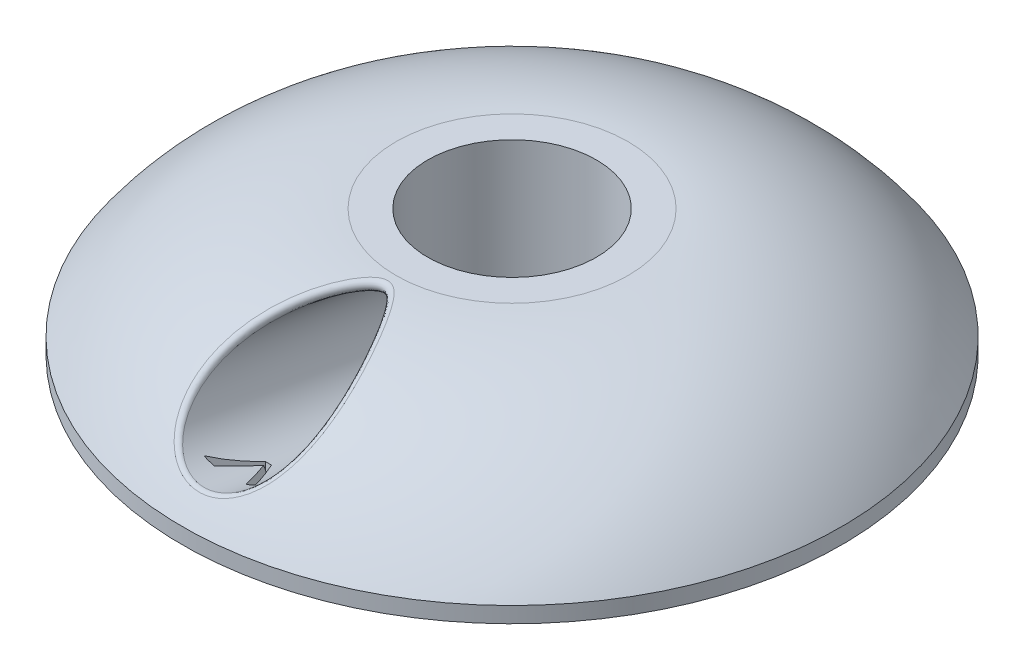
ISO-10303-21;
HEADER;
FILE_DESCRIPTION(('STEP AP214'),'2;1');
FILE_NAME('part.step','',(''),(''),'','','');
FILE_SCHEMA(('AUTOMOTIVE_DESIGN { 1 0 10303 214 1 1 1 1 }'));
ENDSEC;
DATA;
#1=APPLICATION_CONTEXT('core data for automotive mechanical design processes');
#2=APPLICATION_PROTOCOL_DEFINITION('international standard','automotive_design',2000,#1);
#3=PRODUCT_CONTEXT('',#1,'mechanical');
#4=PRODUCT('Part','Part','',(#3));
#5=PRODUCT_RELATED_PRODUCT_CATEGORY('part','',(#4));
#6=PRODUCT_DEFINITION_FORMATION('','',#4);
#7=PRODUCT_DEFINITION_CONTEXT('part definition',#1,'design');
#8=PRODUCT_DEFINITION('design','',#6,#7);
#9=PRODUCT_DEFINITION_SHAPE('','',#8);
#10=(LENGTH_UNIT() NAMED_UNIT(*) SI_UNIT(.MILLI.,.METRE.));
#11=(NAMED_UNIT(*) PLANE_ANGLE_UNIT() SI_UNIT($,.RADIAN.));
#12=(NAMED_UNIT(*) SI_UNIT($,.STERADIAN.) SOLID_ANGLE_UNIT());
#13=UNCERTAINTY_MEASURE_WITH_UNIT(LENGTH_MEASURE(1.E-05),#10,'distance_accuracy_value','');
#14=(GEOMETRIC_REPRESENTATION_CONTEXT(3) GLOBAL_UNCERTAINTY_ASSIGNED_CONTEXT((#13)) GLOBAL_UNIT_ASSIGNED_CONTEXT((#10,
#11,#12)) REPRESENTATION_CONTEXT('',''));
#15=CARTESIAN_POINT('',(0.,0.,0.));
#16=DIRECTION('',(0.,0.,1.));
#17=DIRECTION('',(1.,0.,0.));
#18=AXIS2_PLACEMENT_3D('',#15,#16,#17);
#19=CARTESIAN_POINT('',(8.,0.,0.));
#20=DIRECTION('',(0.,-1.,0.));
#21=DIRECTION('',(0.,0.,-1.));
#22=AXIS2_PLACEMENT_3D('',#19,#20,#21);
#23=PLANE('',#22);
#24=CARTESIAN_POINT('',(0.,0.,0.));
#25=DIRECTION('',(0.,-1.,0.));
#26=DIRECTION('',(0.,0.,-1.));
#27=AXIS2_PLACEMENT_3D('',#24,#25,#26);
#28=CIRCLE('',#27,31.25);
#29=CARTESIAN_POINT('',(0.,0.,-31.25));
#30=VERTEX_POINT('',#29);
#31=EDGE_CURVE('E267',#30,#30,#28,.T.);
#32=ORIENTED_EDGE('',*,*,#31,.T.);
#33=EDGE_LOOP('',(#32));
#34=FACE_BOUND('',#33,.T.);
#35=CARTESIAN_POINT('',(0.,0.,0.));
#36=DIRECTION('',(0.,-1.,0.));
#37=DIRECTION('',(0.,0.,-1.));
#38=AXIS2_PLACEMENT_3D('',#35,#36,#37);
#39=CIRCLE('',#38,8.);
#40=CARTESIAN_POINT('',(-0.696043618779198,0.,7.96966268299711));
#41=VERTEX_POINT('',#40);
#42=CARTESIAN_POINT('',(0.696043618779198,0.,7.96966268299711));
#43=VERTEX_POINT('',#42);
#44=EDGE_CURVE('E256',#41,#43,#39,.T.);
#45=ORIENTED_EDGE('',*,*,#44,.F.);
#46=CARTESIAN_POINT('',(0.,0.,-21.1252526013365));
#47=DIRECTION('',(0.,-1.,0.));
#48=DIRECTION('',(0.,0.,-1.));
#49=AXIS2_PLACEMENT_3D('',#46,#47,#48);
#50=ELLIPSE('',#49,29.369729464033,5.1);
#51=EDGE_CURVE('E54',#41,#43,#50,.F.);
#52=ORIENTED_EDGE('',*,*,#51,.T.);
#53=EDGE_LOOP('',(#45,#52));
#54=FACE_BOUND('',#53,.T.);
#55=ADVANCED_FACE('F33',(#34,#54),#23,.T.);
#56=CARTESIAN_POINT('',(0.,0.,0.));
#57=DIRECTION('',(0.,-1.,0.));
#58=DIRECTION('',(0.,0.,-1.));
#59=AXIS2_PLACEMENT_3D('',#56,#57,#58);
#60=CYLINDRICAL_SURFACE('',#59,8.);
#61=CARTESIAN_POINT('',(0.,12.,0.));
#62=DIRECTION('',(0.,-1.,0.));
#63=DIRECTION('',(0.,0.,-1.));
#64=AXIS2_PLACEMENT_3D('',#61,#62,#63);
#65=CIRCLE('',#64,8.);
#66=CARTESIAN_POINT('',(0.,12.,-8.));
#67=VERTEX_POINT('',#66);
#68=EDGE_CURVE('E259',#67,#67,#65,.T.);
#69=ORIENTED_EDGE('',*,*,#68,.F.);
#70=EDGE_LOOP('',(#69));
#71=FACE_BOUND('',#70,.T.);
#72=ORIENTED_EDGE('',*,*,#44,.T.);
#73=CARTESIAN_POINT('',(0.696043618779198,0.,7.96966268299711));
#74=CARTESIAN_POINT('',(0.834883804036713,0.0172685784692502,7.95756521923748));
#75=CARTESIAN_POINT('',(0.972735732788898,0.0397223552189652,7.94184283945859));
#76=CARTESIAN_POINT('',(1.24539201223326,0.0946870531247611,7.90365839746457));
#77=CARTESIAN_POINT('',(1.38019801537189,0.12719237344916,7.88120008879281));
#78=CARTESIAN_POINT('',(1.64522132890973,0.201790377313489,7.83016006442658));
#79=CARTESIAN_POINT('',(1.77545728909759,0.243837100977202,7.80160774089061));
#80=CARTESIAN_POINT('',(2.03117776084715,0.337245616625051,7.73896913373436));
#81=CARTESIAN_POINT('',(2.15666172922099,0.388608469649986,7.70488221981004));
#82=CARTESIAN_POINT('',(2.40187142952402,0.500158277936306,7.63199410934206));
#83=CARTESIAN_POINT('',(2.52160896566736,0.560326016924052,7.59320320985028));
#84=CARTESIAN_POINT('',(2.75500600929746,0.689206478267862,7.5116746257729));
#85=CARTESIAN_POINT('',(2.86866321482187,0.757922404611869,7.46893546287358));
#86=CARTESIAN_POINT('',(3.19994857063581,0.976584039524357,7.33599526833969));
#87=CARTESIAN_POINT('',(3.40770425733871,1.13895872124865,7.241128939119));
#88=CARTESIAN_POINT('',(3.80524174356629,1.50592277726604,7.04080426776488));
#89=CARTESIAN_POINT('',(3.99296899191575,1.71257404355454,6.93505858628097));
#90=CARTESIAN_POINT('',(4.32927237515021,2.15842965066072,6.73023682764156));
#91=CARTESIAN_POINT('',(4.47789207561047,2.39759731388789,6.63115342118));
#92=CARTESIAN_POINT('',(4.70512424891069,2.85386602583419,6.4712554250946));
#93=CARTESIAN_POINT('',(4.7918226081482,3.06559934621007,6.40675517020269));
#94=CARTESIAN_POINT('',(4.89859023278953,3.39424369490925,6.3250140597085));
#95=CARTESIAN_POINT('',(4.93029664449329,3.50561617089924,6.30027098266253));
#96=CARTESIAN_POINT('',(4.98572153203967,3.7314136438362,6.25650342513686));
#97=CARTESIAN_POINT('',(5.00944309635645,3.84583744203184,6.23747673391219));
#98=CARTESIAN_POINT('',(5.04880514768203,4.07739328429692,6.20565961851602));
#99=CARTESIAN_POINT('',(5.06441344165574,4.1945342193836,6.19289404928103));
#100=CARTESIAN_POINT('',(5.08737413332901,4.43015407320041,6.17404611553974));
#101=CARTESIAN_POINT('',(5.09472654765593,4.54863298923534,6.16796373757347));
#102=CARTESIAN_POINT('',(5.10128884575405,4.78599423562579,6.16253787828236));
#103=CARTESIAN_POINT('',(5.10049691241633,4.90487665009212,6.16319590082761));
#104=CARTESIAN_POINT('',(5.0910233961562,5.14212654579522,6.17102129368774));
#105=CARTESIAN_POINT('',(5.08233874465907,5.26049380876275,6.17819119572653));
#106=CARTESIAN_POINT('',(5.04608198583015,5.60283563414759,6.20790551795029));
#107=CARTESIAN_POINT('',(5.00852089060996,5.82513450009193,6.23849819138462));
#108=CARTESIAN_POINT('',(4.90866399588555,6.26075714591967,6.31735477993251));
#109=CARTESIAN_POINT('',(4.846349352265,6.47407395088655,6.3656321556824));
#110=CARTESIAN_POINT('',(4.71765068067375,6.83804582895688,6.46130890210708));
#111=CARTESIAN_POINT('',(4.65607251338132,6.99116536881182,6.50598046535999));
#112=CARTESIAN_POINT('',(4.52104384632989,7.29047517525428,6.6005269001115));
#113=CARTESIAN_POINT('',(4.44758856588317,7.43666262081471,6.65040386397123));
#114=CARTESIAN_POINT('',(4.28920952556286,7.72181251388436,6.75363877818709));
#115=CARTESIAN_POINT('',(4.20426219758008,7.8607592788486,6.80700376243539));
#116=CARTESIAN_POINT('',(4.02337176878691,8.13055662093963,6.91546100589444));
#117=CARTESIAN_POINT('',(3.92743006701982,8.26140822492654,6.97055304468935));
#118=CARTESIAN_POINT('',(3.72348314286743,8.51596550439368,7.08161864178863));
#119=CARTESIAN_POINT('',(3.61534247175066,8.63956179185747,7.13759462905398));
#120=CARTESIAN_POINT('',(3.38812617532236,8.87696640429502,7.24821181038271));
#121=CARTESIAN_POINT('',(3.26904908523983,8.99077341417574,7.30285282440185));
#122=CARTESIAN_POINT('',(3.02042473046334,9.20722867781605,7.40913274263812));
#123=CARTESIAN_POINT('',(2.89090378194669,9.30990353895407,7.46077866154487));
#124=CARTESIAN_POINT('',(2.62152228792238,9.50304184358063,7.55964606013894));
#125=CARTESIAN_POINT('',(2.48166232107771,9.59350596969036,7.6068677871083));
#126=CARTESIAN_POINT('',(2.13015601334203,9.79639322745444,7.71420208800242));
#127=CARTESIAN_POINT('',(1.91331593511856,9.90174681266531,7.77123307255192));
#128=CARTESIAN_POINT('',(1.57577721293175,10.0348589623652,7.84412225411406));
#129=CARTESIAN_POINT('',(1.46120075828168,10.0750805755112,7.86631134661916));
#130=CARTESIAN_POINT('',(1.22852576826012,10.1466591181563,7.90598624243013));
#131=CARTESIAN_POINT('',(1.11042864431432,10.1780195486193,7.92347390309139));
#132=CARTESIAN_POINT('',(0.87069297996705,10.2315170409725,7.95340103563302));
#133=CARTESIAN_POINT('',(0.749036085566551,10.2535912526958,7.9658060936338));
#134=CARTESIAN_POINT('',(0.503888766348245,10.2877964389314,7.9850615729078));
#135=CARTESIAN_POINT('',(0.380398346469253,10.299927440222,7.99191200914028));
#136=CARTESIAN_POINT('',(0.132682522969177,10.313996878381,7.99985925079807));
#137=CARTESIAN_POINT('',(0.00845731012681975,10.3159378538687,8.00095748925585));
#138=CARTESIAN_POINT('',(-0.23964022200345,10.3095941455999,7.99737225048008));
#139=CARTESIAN_POINT('',(-0.363512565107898,10.3013101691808,7.99268917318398));
#140=CARTESIAN_POINT('',(-0.59767646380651,10.2760001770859,7.97841796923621));
#141=CARTESIAN_POINT('',(-0.708103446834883,10.2599160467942,7.96935866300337));
#142=CARTESIAN_POINT('',(-0.927074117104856,10.2198420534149,7.94686558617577));
#143=CARTESIAN_POINT('',(-1.03561716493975,10.1958495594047,7.93343035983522));
#144=CARTESIAN_POINT('',(-1.35735553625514,10.1125182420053,7.88697627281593));
#145=CARTESIAN_POINT('',(-1.56682994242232,10.0418065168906,7.84779801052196));
#146=CARTESIAN_POINT('',(-1.98201217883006,9.86931095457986,7.75367153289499));
#147=CARTESIAN_POINT('',(-2.18694742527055,9.76609305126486,7.69800452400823));
#148=CARTESIAN_POINT('',(-2.57845442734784,9.53449537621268,7.57586025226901));
#149=CARTESIAN_POINT('',(-2.76502027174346,9.40610754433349,7.50937952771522));
#150=CARTESIAN_POINT('',(-3.1528664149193,9.10098039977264,7.35601599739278));
#151=CARTESIAN_POINT('',(-3.34997665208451,8.91969298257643,7.26767754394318));
#152=CARTESIAN_POINT('',(-3.71569401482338,8.53130999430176,7.08768027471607));
#153=CARTESIAN_POINT('',(-3.88425514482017,8.32417369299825,6.9960163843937));
#154=CARTESIAN_POINT('',(-4.13136108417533,7.97344868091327,6.85153797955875));
#155=CARTESIAN_POINT('',(-4.21927557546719,7.83681372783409,6.79759164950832));
#156=CARTESIAN_POINT('',(-4.38391899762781,7.55581506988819,6.69259156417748));
#157=CARTESIAN_POINT('',(-4.46064510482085,7.41144942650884,6.64153854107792));
#158=CARTESIAN_POINT('',(-4.60230245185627,7.11571088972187,6.54417272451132));
#159=CARTESIAN_POINT('',(-4.6672478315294,6.96434667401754,6.4978542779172));
#160=CARTESIAN_POINT('',(-4.78473958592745,6.65507856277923,6.41182944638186));
#161=CARTESIAN_POINT('',(-4.83728514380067,6.49717423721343,6.37212349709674));
#162=CARTESIAN_POINT('',(-4.94918137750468,6.10478204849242,6.28590873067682));
#163=CARTESIAN_POINT('',(-5.00140902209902,5.86708001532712,6.24405410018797));
#164=CARTESIAN_POINT('',(-5.05630204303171,5.5050583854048,6.19954213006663));
#165=CARTESIAN_POINT('',(-5.07069080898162,5.38351173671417,6.18775063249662));
#166=CARTESIAN_POINT('',(-5.09126435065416,5.13927422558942,6.17083615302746));
#167=CARTESIAN_POINT('',(-5.09745251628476,5.01658385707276,6.1657104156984));
#168=CARTESIAN_POINT('',(-5.10128475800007,4.77009466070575,6.1625399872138));
#169=CARTESIAN_POINT('',(-5.0988674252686,4.64629417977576,6.16454618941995));
#170=CARTESIAN_POINT('',(-5.08512476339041,4.39951964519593,6.1758874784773));
#171=CARTESIAN_POINT('',(-5.07379947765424,4.27654558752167,6.18522252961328));
#172=CARTESIAN_POINT('',(-5.04217791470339,4.03247381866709,6.21102695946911));
#173=CARTESIAN_POINT('',(-5.02187853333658,3.91137677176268,6.2274988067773));
#174=CARTESIAN_POINT('',(-4.97242774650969,3.6721153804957,6.26705368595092));
#175=CARTESIAN_POINT('',(-4.94327651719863,3.55395097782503,6.29013658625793));
#176=CARTESIAN_POINT('',(-4.87943027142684,3.33198927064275,6.33976631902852));
#177=CARTESIAN_POINT('',(-4.84548048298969,3.2278626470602,6.36580724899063));
#178=CARTESIAN_POINT('',(-4.77075108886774,3.02321895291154,6.42200297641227));
#179=CARTESIAN_POINT('',(-4.72996922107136,2.92270309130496,6.45215913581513));
#180=CARTESIAN_POINT('',(-4.59782117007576,2.62720744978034,6.54765835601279));
#181=CARTESIAN_POINT('',(-4.49661939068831,2.43816553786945,6.61805904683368));
#182=CARTESIAN_POINT('',(-4.25601303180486,2.05503293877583,6.77566034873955));
#183=CARTESIAN_POINT('',(-4.11337112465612,1.86341262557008,6.86385734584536));
#184=CARTESIAN_POINT('',(-3.80076652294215,1.50437903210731,7.04176832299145));
#185=CARTESIAN_POINT('',(-3.63078003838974,1.33698707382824,7.13148356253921));
#186=CARTESIAN_POINT('',(-3.34257412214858,1.09263941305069,7.26918774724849));
#187=CARTESIAN_POINT('',(-3.23235191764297,1.00709324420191,7.31896675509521));
#188=CARTESIAN_POINT('',(-3.00419089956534,0.845110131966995,7.4155347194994));
#189=CARTESIAN_POINT('',(-2.8862544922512,0.768670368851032,7.46232459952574));
#190=CARTESIAN_POINT('',(-2.64335565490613,0.625323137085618,7.55178248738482));
#191=CARTESIAN_POINT('',(-2.51839774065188,0.558409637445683,7.59445309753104));
#192=CARTESIAN_POINT('',(-2.26215138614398,0.434508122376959,7.67467752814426));
#193=CARTESIAN_POINT('',(-2.13086657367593,0.377514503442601,7.71223423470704));
#194=CARTESIAN_POINT('',(-1.89382205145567,0.285867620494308,7.77333657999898));
#195=CARTESIAN_POINT('',(-1.78919110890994,0.249097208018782,7.79811284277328));
#196=CARTESIAN_POINT('',(-1.57710721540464,0.181853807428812,7.84375519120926));
#197=CARTESIAN_POINT('',(-1.46965487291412,0.151379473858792,7.86462211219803));
#198=CARTESIAN_POINT('',(-1.25222118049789,0.096861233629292,7.90215912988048));
#199=CARTESIAN_POINT('',(-1.14223607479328,0.0728276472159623,7.91882248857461));
#200=CARTESIAN_POINT('',(-0.920396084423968,0.0313945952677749,7.947668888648));
#201=CARTESIAN_POINT('',(-0.808540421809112,0.0139979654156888,7.95985001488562));
#202=CARTESIAN_POINT('',(-0.696043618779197,0.,7.96966268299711));
#203=B_SPLINE_CURVE_WITH_KNOTS('',3,(#73,#74,#75,#76,#77,#78,#79,#80,#81,#82,#83,#84,#85,#86,
#87,#88,#89,#90,#91,#92,#93,#94,#95,#96,#97,#98,#99,#100,#101,#102,#103,#104,#105,#106,#107,
#108,#109,#110,#111,#112,#113,#114,#115,#116,#117,#118,#119,#120,#121,#122,#123,#124,#125,#126,
#127,#128,#129,#130,#131,#132,#133,#134,#135,#136,#137,#138,#139,#140,#141,#142,#143,#144,#145,
#146,#147,#148,#149,#150,#151,#152,#153,#154,#155,#156,#157,#158,#159,#160,#161,#162,#163,#164,
#165,#166,#167,#168,#169,#170,#171,#172,#173,#174,#175,#176,#177,#178,#179,#180,#181,#182,#183,
#184,#185,#186,#187,#188,#189,#190,#191,#192,#193,#194,#195,#196,#197,#198,#199,#200,#201,#202),
.UNSPECIFIED.,.F.,.F.,(4,2,2,2,2,2,2,2,2,2,2,2,2,2,2,2,2,2,2,2,2,2,2,2,2,2,2,2,2,2,2,2,2,2,2,2,
2,2,2,2,2,2,2,2,2,2,2,2,2,2,2,2,2,2,2,2,2,2,2,2,2,2,2,2,4),(0.,0.421112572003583,
0.841990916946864,1.26088342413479,1.67982367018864,2.09786286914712,2.51605923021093,
3.35308239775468,4.24466974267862,5.13525961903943,5.84516196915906,6.20001377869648,
6.55472817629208,6.91083951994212,7.26695014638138,7.62314022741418,7.9794688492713,
8.65927077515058,9.33959120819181,9.8518926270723,10.3644007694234,10.8779763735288,
11.3914866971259,11.9113970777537,12.4313771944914,12.9500857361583,13.4687652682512,
14.2084682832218,14.5784246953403,14.9482347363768,15.3205089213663,15.6927821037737,
16.0649625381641,16.437117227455,16.7725995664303,17.1081936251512,17.7788740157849,
18.4846993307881,19.1907510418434,20.0338144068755,20.8782233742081,21.3913250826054,
21.9045560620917,22.4171668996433,22.9298114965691,23.6672963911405,24.0358096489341,
24.4041705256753,24.7751652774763,25.1461582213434,25.5172795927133,25.8883935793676,
26.2257587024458,26.5632357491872,27.2378282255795,27.9990691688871,28.7609760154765,
29.2049535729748,29.6487932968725,30.0923507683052,30.5356568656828,30.8763127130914,
31.216895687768,31.5580211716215,31.8992922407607),.UNSPECIFIED.);
#204=EDGE_CURVE('E147',#43,#41,#203,.T.);
#205=ORIENTED_EDGE('',*,*,#204,.T.);
#206=EDGE_LOOP('',(#72,#205));
#207=FACE_BOUND('',#206,.T.);
#208=ADVANCED_FACE('F155',(#71,#207),#60,.F.);
#209=CARTESIAN_POINT('',(0.,-12.7767857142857,0.));
#210=DIRECTION('',(0.,-1.,0.));
#211=DIRECTION('',(0.,0.,-1.));
#212=AXIS2_PLACEMENT_3D('',#209,#210,#211);
#213=DEGENERATE_TOROIDAL_SURFACE('',#212,11.,24.7767857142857,.T.);
#214=CARTESIAN_POINT('',(3.68186935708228,4.99757324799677,27.5400923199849));
#215=CARTESIAN_POINT('',(3.73947615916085,5.08025451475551,27.6628861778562));
#216=CARTESIAN_POINT('',(3.85270653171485,5.08530109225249,27.774180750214));
#217=CARTESIAN_POINT('',(3.96593690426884,5.09034766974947,27.8854753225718));
#218=CARTESIAN_POINT('',(4.09326749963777,5.01590889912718,27.9444571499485));
#219=CARTESIAN_POINT('',(3.51122397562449,4.85116772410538,27.7351326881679));
#220=CARTESIAN_POINT('',(3.56847897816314,4.92762800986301,27.8582047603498));
#221=CARTESIAN_POINT('',(3.67579543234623,4.92671940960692,27.9713394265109));
#222=CARTESIAN_POINT('',(3.78375413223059,4.92638741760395,28.0837587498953));
#223=CARTESIAN_POINT('',(3.90375362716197,4.84894332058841,28.1463561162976));
#224=CARTESIAN_POINT('',(3.32354889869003,4.71089703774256,27.9183545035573));
#225=CARTESIAN_POINT('',(3.37941739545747,4.78097600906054,28.0421660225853));
#226=CARTESIAN_POINT('',(3.48067696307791,4.77477663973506,28.1565961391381));
#227=CARTESIAN_POINT('',(3.58259265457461,4.76901084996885,28.2705054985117));
#228=CARTESIAN_POINT('',(3.69526143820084,4.68903649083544,28.3360570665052));
#229=CARTESIAN_POINT('',(2.91430160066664,4.44917572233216,28.2553140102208));
#230=CARTESIAN_POINT('',(2.96592898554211,4.50736261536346,28.3803736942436));
#231=CARTESIAN_POINT('',(3.05421311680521,4.4912707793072,28.4973588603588));
#232=CARTESIAN_POINT('',(3.14314136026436,4.47560972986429,28.6138258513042));
#233=CARTESIAN_POINT('',(3.24050145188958,4.39076132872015,28.6849814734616));
#234=CARTESIAN_POINT('',(2.6927369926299,4.32772087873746,28.4090583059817));
#235=CARTESIAN_POINT('',(2.74149654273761,4.38025689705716,28.5348160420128));
#236=CARTESIAN_POINT('',(2.82287587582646,4.3597031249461,28.6528715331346));
#237=CARTESIAN_POINT('',(2.90484408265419,4.33942963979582,28.7705983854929));
#238=CARTESIAN_POINT('',(2.99424213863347,4.25238817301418,28.8442117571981));
#239=CARTESIAN_POINT('',(2.33666885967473,4.16494502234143,28.6128940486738));
#240=CARTESIAN_POINT('',(2.37996129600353,4.20985474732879,28.7396034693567));
#241=CARTESIAN_POINT('',(2.45053837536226,4.18337176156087,28.8590799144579));
#242=CARTESIAN_POINT('',(2.52126974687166,4.15696113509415,28.9784721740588));
#243=CARTESIAN_POINT('',(2.59841958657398,4.06697600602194,29.0553437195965));
#244=CARTESIAN_POINT('',(2.21333336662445,4.11370947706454,28.6766318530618));
#245=CARTESIAN_POINT('',(2.25468757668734,4.15623159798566,28.8036179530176));
#246=CARTESIAN_POINT('',(2.32147787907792,4.12786905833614,28.9235650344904));
#247=CARTESIAN_POINT('',(2.38840603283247,4.09955966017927,29.0434507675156));
#248=CARTESIAN_POINT('',(2.46130301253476,4.00862264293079,29.1213673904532));
#249=CARTESIAN_POINT('',(1.95970346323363,4.01893546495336,28.7939673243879));
#250=CARTESIAN_POINT('',(1.99689698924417,4.05704544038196,28.9214496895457));
#251=CARTESIAN_POINT('',(2.05591985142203,4.02520130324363,29.0422835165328));
#252=CARTESIAN_POINT('',(2.11507863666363,3.99340986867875,29.1630563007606));
#253=CARTESIAN_POINT('',(2.17931449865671,3.9006919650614,29.2429168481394));
#254=CARTESIAN_POINT('',(1.8294129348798,3.97539276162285,28.8475705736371));
#255=CARTESIAN_POINT('',(1.86436805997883,4.0114606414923,28.9752938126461));
#256=CARTESIAN_POINT('',(1.91942646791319,3.97803166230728,29.0965225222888));
#257=CARTESIAN_POINT('',(1.97460204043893,3.94463818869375,29.2177105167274));
#258=CARTESIAN_POINT('',(2.03444688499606,3.85110981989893,29.2984484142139));
#259=CARTESIAN_POINT('',(1.56288477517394,3.89692367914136,28.9438044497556));
#260=CARTESIAN_POINT('',(1.59312462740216,3.92931853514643,29.0719468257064));
#261=CARTESIAN_POINT('',(1.64008352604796,3.89302615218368,29.1939025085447));
#262=CARTESIAN_POINT('',(1.68715973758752,3.85676961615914,29.3158171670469));
#263=CARTESIAN_POINT('',(1.73808381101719,3.76176320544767,29.3981480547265));
#264=CARTESIAN_POINT('',(1.42665056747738,3.8619924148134,28.9864412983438));
#265=CARTESIAN_POINT('',(1.45439255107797,3.89274057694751,29.1147805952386));
#266=CARTESIAN_POINT('',(1.49723762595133,3.85518499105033,29.2370497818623));
#267=CARTESIAN_POINT('',(1.54017531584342,3.81765060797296,29.359294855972));
#268=CARTESIAN_POINT('',(1.58659216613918,3.72199316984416,29.4423225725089));
#269=CARTESIAN_POINT('',(1.14947851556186,3.80150332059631,29.0600700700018));
#270=CARTESIAN_POINT('',(1.17204588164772,3.82940748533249,29.1887380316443));
#271=CARTESIAN_POINT('',(1.20651886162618,3.78965681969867,29.3115626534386));
#272=CARTESIAN_POINT('',(1.24108484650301,3.74992679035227,29.4343638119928));
#273=CARTESIAN_POINT('',(1.27836683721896,3.65312845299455,29.5186088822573));
#274=CARTESIAN_POINT('',(1.00854162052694,3.77594361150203,29.0910643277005));
#275=CARTESIAN_POINT('',(1.0284065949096,3.8026376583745,29.2198790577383));
#276=CARTESIAN_POINT('',(1.05864701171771,3.76196777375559,29.3429306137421));
#277=CARTESIAN_POINT('',(1.08895259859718,3.72130626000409,29.4659726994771));
#278=CARTESIAN_POINT('',(1.12163421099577,3.62403163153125,29.5507230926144));
#279=CARTESIAN_POINT('',(0.623627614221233,3.72048437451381,29.1582136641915));
#280=CARTESIAN_POINT('',(0.636099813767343,3.74457364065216,29.2873207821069));
#281=CARTESIAN_POINT('',(0.654706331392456,3.70188826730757,29.4108909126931));
#282=CARTESIAN_POINT('',(0.673496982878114,3.65923252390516,29.5344275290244));
#283=CARTESIAN_POINT('',(0.693569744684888,3.56089933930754,29.6202999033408));
#284=CARTESIAN_POINT('',(0.376353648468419,3.69999512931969,29.1828866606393));
#285=CARTESIAN_POINT('',(0.38384970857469,3.72310135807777,29.3121236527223));
#286=CARTESIAN_POINT('',(0.395118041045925,3.67969200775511,29.4358636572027));
#287=CARTESIAN_POINT('',(0.40641199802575,3.63628337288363,29.5596028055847));
#288=CARTESIAN_POINT('',(0.418564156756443,3.53757761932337,29.6458662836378));
#289=CARTESIAN_POINT('',(-0.11945726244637,3.68952837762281,29.1955042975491));
#290=CARTESIAN_POINT('',(-0.121816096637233,3.71213976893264,29.3247993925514));
#291=CARTESIAN_POINT('',(-0.12541199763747,3.66835324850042,29.4486344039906));
#292=CARTESIAN_POINT('',(-0.128977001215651,3.62456724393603,29.5724688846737));
#293=CARTESIAN_POINT('',(-0.132855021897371,3.52566368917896,29.6589406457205));
#294=CARTESIAN_POINT('',(-0.367993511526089,3.69953556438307,29.1834673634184));
#295=CARTESIAN_POINT('',(-0.375390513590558,3.72262748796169,29.3126987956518));
#296=CARTESIAN_POINT('',(-0.386353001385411,3.67919416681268,29.4364510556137));
#297=CARTESIAN_POINT('',(-0.397449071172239,3.63577571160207,29.5601866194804));
#298=CARTESIAN_POINT('',(-0.409267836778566,3.53705405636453,29.6464677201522));
#299=CARTESIAN_POINT('',(-0.838321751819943,3.74719837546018,29.1258854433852));
#300=CARTESIAN_POINT('',(-0.854939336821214,3.77253858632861,29.25485631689));
#301=CARTESIAN_POINT('',(-0.880033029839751,3.73082780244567,29.3781720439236));
#302=CARTESIAN_POINT('',(-0.905238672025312,3.68912790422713,29.5014754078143));
#303=CARTESIAN_POINT('',(-0.932334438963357,3.59130906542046,29.5868028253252));
#304=CARTESIAN_POINT('',(-1.06065514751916,3.78256140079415,29.0831183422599));
#305=CARTESIAN_POINT('',(-1.08162338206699,3.80958930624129,29.2118723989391));
#306=CARTESIAN_POINT('',(-1.11335038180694,3.76913692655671,29.3348877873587));
#307=CARTESIAN_POINT('',(-1.1453021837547,3.72873503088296,29.4578458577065));
#308=CARTESIAN_POINT('',(-1.17959156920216,3.63156388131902,29.5424891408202));
#309=CARTESIAN_POINT('',(-1.49370866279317,3.87620618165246,28.9691478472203));
#310=CARTESIAN_POINT('',(-1.52277101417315,3.90763654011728,29.0973937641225));
#311=CARTESIAN_POINT('',(-1.56757686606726,3.87058284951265,29.21954857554));
#312=CARTESIAN_POINT('',(-1.61260678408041,3.8335789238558,29.3416467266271));
#313=CARTESIAN_POINT('',(-1.6611636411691,3.73817491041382,29.4244048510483));
#314=CARTESIAN_POINT('',(-1.70442830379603,3.93448888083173,28.8979432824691));
#315=CARTESIAN_POINT('',(-1.73733219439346,3.96868222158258,29.0258410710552));
#316=CARTESIAN_POINT('',(-1.78848548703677,3.93372067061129,29.1474924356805));
#317=CARTESIAN_POINT('',(-1.83995137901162,3.89886829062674,29.2690182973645));
#318=CARTESIAN_POINT('',(-1.89547804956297,3.80453219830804,29.3506330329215));
#319=CARTESIAN_POINT('',(-2.11810692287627,4.07361915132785,28.7264893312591));
#320=CARTESIAN_POINT('',(-2.15807308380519,4.11431086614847,28.8536466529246));
#321=CARTESIAN_POINT('',(-2.22183527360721,4.08443978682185,28.9740072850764));
#322=CARTESIAN_POINT('',(-2.28593562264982,4.05468585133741,29.0942329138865));
#323=CARTESIAN_POINT('',(-2.35543679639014,3.96296309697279,29.1730131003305));
#324=CARTESIAN_POINT('',(-2.32039424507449,4.15529337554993,28.6251694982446));
#325=CARTESIAN_POINT('',(-2.36361397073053,4.19982129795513,28.751853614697));
#326=CARTESIAN_POINT('',(-2.43355872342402,4.17291655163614,28.8714958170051));
#327=CARTESIAN_POINT('',(-2.50390591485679,4.14620878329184,28.9909072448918));
#328=CARTESIAN_POINT('',(-2.58033261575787,4.05597892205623,29.0680565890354));
#329=CARTESIAN_POINT('',(-2.70428022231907,4.33596266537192,28.3984854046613));
#330=CARTESIAN_POINT('',(-2.75305797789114,4.38883373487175,28.5242521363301));
#331=CARTESIAN_POINT('',(-2.83489498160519,4.36863099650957,28.6421788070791));
#332=CARTESIAN_POINT('',(-2.91713704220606,4.34862505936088,28.7598748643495));
#333=CARTESIAN_POINT('',(-3.00706790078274,4.26178041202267,28.8332630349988));
#334=CARTESIAN_POINT('',(-2.88587137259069,4.43496398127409,28.2731124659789));
#335=CARTESIAN_POINT('',(-2.93699737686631,4.49242114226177,28.3983352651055));
#336=CARTESIAN_POINT('',(-3.02449976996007,4.47587544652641,28.5153644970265));
#337=CARTESIAN_POINT('',(-3.11243696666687,4.45961010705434,28.6320580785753));
#338=CARTESIAN_POINT('',(-3.20889900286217,4.3745732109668,28.7034170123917));
#339=CARTESIAN_POINT('',(-3.24958493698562,4.66040611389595,27.9837583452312));
#340=CARTESIAN_POINT('',(-3.30472613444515,4.72816487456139,28.1078506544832));
#341=CARTESIAN_POINT('',(-3.40367132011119,4.72008360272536,28.2227331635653));
#342=CARTESIAN_POINT('',(-3.50317624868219,4.71236247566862,28.3371837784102));
#343=CARTESIAN_POINT('',(-3.61308029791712,4.63148683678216,28.4037792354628));
#344=CARTESIAN_POINT('',(-3.42848208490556,4.7887467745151,27.816851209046));
#345=CARTESIAN_POINT('',(-3.48510334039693,4.86235356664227,27.9402710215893));
#346=CARTESIAN_POINT('',(-3.58979061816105,4.85910467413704,28.0539632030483));
#347=CARTESIAN_POINT('',(-3.69503393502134,4.85633119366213,28.1670680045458));
#348=CARTESIAN_POINT('',(-3.81183612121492,4.7777810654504,28.2309625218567));
#349=CARTESIAN_POINT('',(-3.7569151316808,5.05708311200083,27.4616219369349));
#350=CARTESIAN_POINT('',(-3.81523901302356,5.14265546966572,27.5838574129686));
#351=CARTESIAN_POINT('',(-3.93063529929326,5.14976158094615,27.6948481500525));
#352=CARTESIAN_POINT('',(-4.04659341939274,5.15734554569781,27.8052484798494));
#353=CARTESIAN_POINT('',(-4.17662634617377,5.08376203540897,27.863219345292));
#354=CARTESIAN_POINT('',(-3.90640834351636,5.19709531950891,27.2732692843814));
#355=CARTESIAN_POINT('',(-3.96492568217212,5.28888757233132,27.3948433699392));
#356=CARTESIAN_POINT('',(-4.0853150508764,5.30141530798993,27.5044723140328));
#357=CARTESIAN_POINT('',(-4.20622089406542,5.31452014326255,27.6133618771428));
#358=CARTESIAN_POINT('',(-4.34261317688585,5.24346777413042,27.6682613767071));
#359=CARTESIAN_POINT('',(-4.14456056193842,5.45005043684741,26.9261172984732));
#360=CARTESIAN_POINT('',(-4.2022706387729,5.55271430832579,27.0468517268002));
#361=CARTESIAN_POINT('',(-4.33085224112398,5.57538906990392,27.1536762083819));
#362=CARTESIAN_POINT('',(-4.45973813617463,5.59840274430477,27.2600671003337));
#363=CARTESIAN_POINT('',(-4.6069378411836,5.53211991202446,27.3090028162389));
#364=CARTESIAN_POINT('',(-4.23925062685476,5.56158502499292,26.7708316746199));
#365=CARTESIAN_POINT('',(-4.29628072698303,5.66905671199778,26.8911212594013));
#366=CARTESIAN_POINT('',(-4.42815704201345,5.69618691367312,26.9967873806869));
#367=CARTESIAN_POINT('',(-4.56030585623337,5.72369159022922,27.1019587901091));
#368=CARTESIAN_POINT('',(-4.71199643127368,5.65943219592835,27.1483231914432));
#369=CARTESIAN_POINT('',(-4.41232251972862,5.78680830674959,26.4521033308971));
#370=CARTESIAN_POINT('',(-4.46733961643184,5.90382926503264,26.5716084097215));
#371=CARTESIAN_POINT('',(-4.60533473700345,5.9401038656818,26.674830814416));
#372=CARTESIAN_POINT('',(-4.74360343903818,5.97675577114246,26.7775556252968));
#373=CARTESIAN_POINT('',(-4.90394170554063,5.91660384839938,26.818572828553));
#374=CARTESIAN_POINT('',(-4.49071817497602,5.90049508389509,26.2886676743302));
#375=CARTESIAN_POINT('',(-4.54436911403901,6.02228960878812,26.4077732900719));
#376=CARTESIAN_POINT('',(-4.68522241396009,6.06322090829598,26.5097701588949));
#377=CARTESIAN_POINT('',(-4.82631337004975,6.10456418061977,26.6112072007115));
#378=CARTESIAN_POINT('',(-4.99084379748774,6.0464609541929,26.6495093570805));
#379=CARTESIAN_POINT('',(-4.70302896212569,6.24318362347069,25.7872463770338));
#380=CARTESIAN_POINT('',(-4.75199768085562,6.37968579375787,25.9045051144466));
#381=CARTESIAN_POINT('',(-4.90040969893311,6.43431303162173,26.0034674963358));
#382=CARTESIAN_POINT('',(-5.04977108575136,6.49057316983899,26.1001974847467));
#383=CARTESIAN_POINT('',(-5.22605884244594,6.43804219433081,26.1309034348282));
#384=CARTESIAN_POINT('',(-4.81377230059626,6.47348626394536,25.438591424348));
#385=CARTESIAN_POINT('',(-4.85791303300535,6.61926951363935,25.5550789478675));
#386=CARTESIAN_POINT('',(-5.01092892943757,6.68367456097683,25.651554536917));
#387=CARTESIAN_POINT('',(-5.1645397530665,6.74988787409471,25.7453683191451));
#388=CARTESIAN_POINT('',(-5.34855248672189,6.7014028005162,25.7704060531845));
#389=CARTESIAN_POINT('',(-4.95365677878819,6.8554658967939,24.8365101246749));
#390=CARTESIAN_POINT('',(-4.98794165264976,7.01543703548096,24.9530399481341));
#391=CARTESIAN_POINT('',(-5.14724720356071,7.09719227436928,25.0441249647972));
#392=CARTESIAN_POINT('',(-5.30683615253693,7.17980474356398,25.1339546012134));
#393=CARTESIAN_POINT('',(-5.50291604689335,7.13861961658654,25.1480855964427));
#394=CARTESIAN_POINT('',(-4.99755013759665,7.00884741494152,24.5880758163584));
#395=CARTESIAN_POINT('',(-5.0273193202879,7.17453695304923,24.7043621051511));
#396=CARTESIAN_POINT('',(-5.18881309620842,7.26321725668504,24.7935586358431));
#397=CARTESIAN_POINT('',(-5.35046535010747,7.35277796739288,24.8813864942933));
#398=CARTESIAN_POINT('',(-5.55121900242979,7.31429544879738,24.8913569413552));
#399=CARTESIAN_POINT('',(-5.06207687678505,7.31088476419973,24.0841768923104));
#400=CARTESIAN_POINT('',(-5.08201223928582,7.48743063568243,24.2002644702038));
#401=CARTESIAN_POINT('',(-5.24708511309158,7.59010175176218,24.2855009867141));
#402=CARTESIAN_POINT('',(-5.41231453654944,7.69365969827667,24.3693594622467));
#403=CARTESIAN_POINT('',(-5.62192066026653,7.66048580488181,24.3707566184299));
#404=CARTESIAN_POINT('',(-5.08270422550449,7.45953936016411,23.8287104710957));
#405=CARTESIAN_POINT('',(-5.09719843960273,7.64124027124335,23.944731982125));
#406=CARTESIAN_POINT('',(-5.26378479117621,7.75095991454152,24.0280078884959));
#407=CARTESIAN_POINT('',(-5.43039885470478,7.86158957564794,24.1097858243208));
#408=CARTESIAN_POINT('',(-5.64431264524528,7.83099897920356,24.106883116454));
#409=CARTESIAN_POINT('',(-5.11286077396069,7.89628816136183,23.0535302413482));
#410=CARTESIAN_POINT('',(-5.11003070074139,8.09373931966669,23.1676010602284));
#411=CARTESIAN_POINT('',(-5.2799737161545,8.22347082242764,23.2469485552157));
#412=CARTESIAN_POINT('',(-5.45004801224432,8.35682975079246,23.3202872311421));
#413=CARTESIAN_POINT('',(-5.6761664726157,8.33238974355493,23.3063856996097));
#414=CARTESIAN_POINT('',(-5.09056920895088,8.17487981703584,22.5254848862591));
#415=CARTESIAN_POINT('',(-5.07402341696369,8.38060973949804,22.6397577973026));
#416=CARTESIAN_POINT('',(-5.24546076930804,8.5247486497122,22.7152557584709));
#417=CARTESIAN_POINT('',(-5.41599316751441,8.67246041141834,22.7839394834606));
#418=CARTESIAN_POINT('',(-5.65020116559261,8.65278949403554,22.761349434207));
#419=CARTESIAN_POINT('',(-4.99459900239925,8.61438252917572,21.6277149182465));
#420=CARTESIAN_POINT('',(-4.95408668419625,8.83052564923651,21.7456149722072));
#421=CARTESIAN_POINT('',(-5.12503371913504,8.99975567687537,21.8120040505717));
#422=CARTESIAN_POINT('',(-5.29554664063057,9.17069566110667,21.8751555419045));
#423=CARTESIAN_POINT('',(-5.54149632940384,9.15935576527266,21.835150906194));
#424=CARTESIAN_POINT('',(-4.93945727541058,8.78459649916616,21.2608846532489));
#425=CARTESIAN_POINT('',(-4.88842148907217,9.00453421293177,21.3796595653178));
#426=CARTESIAN_POINT('',(-5.05888995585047,9.18363575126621,21.4431313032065));
#427=CARTESIAN_POINT('',(-5.22859922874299,9.36436811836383,21.5031417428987));
#428=CARTESIAN_POINT('',(-5.47937145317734,9.35587004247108,21.4568305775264));
#429=CARTESIAN_POINT('',(-4.80080486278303,9.10750902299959,20.5236433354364));
#430=CARTESIAN_POINT('',(-4.72818608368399,9.33352617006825,20.644914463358));
#431=CARTESIAN_POINT('',(-4.89638544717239,9.53227208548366,20.7022378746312));
#432=CARTESIAN_POINT('',(-5.06382007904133,9.73265657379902,20.756074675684));
#433=CARTESIAN_POINT('',(-5.32360863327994,9.72938398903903,20.6967531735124));
#434=CARTESIAN_POINT('',(-4.71728244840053,9.26020030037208,20.153230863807));
#435=CARTESIAN_POINT('',(-4.63328949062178,9.48840463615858,20.2759108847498));
#436=CARTESIAN_POINT('',(-4.80001221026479,9.69702040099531,20.3302159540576));
#437=CARTESIAN_POINT('',(-4.96564123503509,9.90717727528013,20.3808023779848));
#438=CARTESIAN_POINT('',(-5.22995766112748,9.90637555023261,20.3149947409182));
#439=CARTESIAN_POINT('',(-4.52553569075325,9.54655305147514,19.4115154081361));
#440=CARTESIAN_POINT('',(-4.41853475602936,9.77754097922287,19.5378572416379));
#441=CARTESIAN_POINT('',(-4.58104286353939,10.0057291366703,19.5858133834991));
#442=CARTESIAN_POINT('',(-4.7424476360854,10.2354736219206,19.6300192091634));
#443=CARTESIAN_POINT('',(-5.0152648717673,10.2391054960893,19.5508168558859));
#444=CARTESIAN_POINT('',(-4.41735027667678,9.68024398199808,19.0402147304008));
#445=CARTESIAN_POINT('',(-4.29840285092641,9.91170444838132,19.1685983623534));
#446=CARTESIAN_POINT('',(-4.45848809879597,10.1497217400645,19.2134342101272));
#447=CARTESIAN_POINT('',(-4.61714073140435,10.3891648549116,19.2542942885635));
#448=CARTESIAN_POINT('',(-4.89426622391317,10.3948767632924,19.1683993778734));
#449=CARTESIAN_POINT('',(-4.17906574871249,9.92818923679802,18.2977777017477));
#450=CARTESIAN_POINT('',(-4.03619709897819,10.1589568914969,18.4312217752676));
#451=CARTESIAN_POINT('',(-4.19020872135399,10.4164456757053,18.4695059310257));
#452=CARTESIAN_POINT('',(-4.34277112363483,10.675373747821,18.5037746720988));
#453=CARTESIAN_POINT('',(-4.62802799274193,10.6846934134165,18.4039867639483));
#454=CARTESIAN_POINT('',(-4.0489737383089,10.0424498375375,17.9266413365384));
#455=CARTESIAN_POINT('',(-3.89381411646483,10.2718976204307,18.0628964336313));
#456=CARTESIAN_POINT('',(-4.04449162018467,10.53918387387,18.0979565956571));
#457=CARTESIAN_POINT('',(-4.19337656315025,10.8077537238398,18.12876620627));
#458=CARTESIAN_POINT('',(-4.48279626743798,10.8187458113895,18.0219915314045));
#459=CARTESIAN_POINT('',(-3.81682688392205,10.2155052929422,17.3127683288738));
#460=CARTESIAN_POINT('',(-3.64200925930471,10.4410125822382,17.4559104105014));
#461=CARTESIAN_POINT('',(-3.78563484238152,10.7247202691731,17.4841512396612));
#462=CARTESIAN_POINT('',(-3.92847645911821,11.0089906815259,17.5105331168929));
#463=CARTESIAN_POINT('',(-4.223863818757,11.022662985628,17.3903619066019));
#464=CARTESIAN_POINT('',(-3.72039731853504,10.279905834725,17.0695242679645));
#465=CARTESIAN_POINT('',(-3.53752093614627,10.5035467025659,17.215116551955));
#466=CARTESIAN_POINT('',(-3.6783950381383,10.7936628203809,17.2411305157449));
#467=CARTESIAN_POINT('',(-3.81838066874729,11.0842909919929,17.2652149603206));
#468=CARTESIAN_POINT('',(-4.11636404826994,11.0988015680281,17.1401353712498));
#469=CARTESIAN_POINT('',(-3.5192708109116,10.4001265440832,16.5843019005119));
#470=CARTESIAN_POINT('',(-3.32045147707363,10.6192382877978,16.7354206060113));
#471=CARTESIAN_POINT('',(-3.45532090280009,10.9221232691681,16.7568644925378));
#472=CARTESIAN_POINT('',(-3.58929434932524,11.2255237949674,16.7763640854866));
#473=CARTESIAN_POINT('',(-3.89227777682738,11.2414673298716,16.6410885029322));
#474=CARTESIAN_POINT('',(-3.4145743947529,10.4559472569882,16.3423235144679));
#475=CARTESIAN_POINT('',(-3.20776960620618,10.6723399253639,16.4964541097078));
#476=CARTESIAN_POINT('',(-3.33948711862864,10.9816417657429,16.5156190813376));
#477=CARTESIAN_POINT('',(-3.47019467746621,11.2914047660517,16.5327645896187));
#478=CARTESIAN_POINT('',(-3.77569185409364,11.3079951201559,16.392268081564));
#479=CARTESIAN_POINT('',(-3.19649792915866,10.5592564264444,15.8591875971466));
#480=CARTESIAN_POINT('',(-2.97400577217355,10.76935741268,16.020164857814));
#481=CARTESIAN_POINT('',(-3.09887952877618,11.091490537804,16.0346479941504));
#482=CARTESIAN_POINT('',(-3.22272439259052,11.4140933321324,16.0470749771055));
#483=CARTESIAN_POINT('',(-3.5329993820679,11.4317242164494,15.8955722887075));
#484=CARTESIAN_POINT('',(-3.08308010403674,10.6067053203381,15.618038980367));
#485=CARTESIAN_POINT('',(-2.85277918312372,10.8131654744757,15.7827958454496));
#486=CARTESIAN_POINT('',(-2.9740670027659,11.1417772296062,15.7949344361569));
#487=CARTESIAN_POINT('',(-3.09419566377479,11.4707982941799,15.8049354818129));
#488=CARTESIAN_POINT('',(-3.40685145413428,11.4888811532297,15.6477065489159));
#489=CARTESIAN_POINT('',(-2.84771044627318,10.6930005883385,15.1387183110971));
#490=CARTESIAN_POINT('',(-2.60235932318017,10.8912668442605,15.3121793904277));
#491=CARTESIAN_POINT('',(-2.71589261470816,11.2328322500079,15.31949706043));
#492=CARTESIAN_POINT('',(-2.82825488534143,11.5748101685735,15.3246611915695));
#493=CARTESIAN_POINT('',(-3.14524223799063,11.5935295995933,15.1551318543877));
#494=CARTESIAN_POINT('',(-2.72576248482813,10.7318508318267,14.900544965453));
#495=CARTESIAN_POINT('',(-2.47303841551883,10.9254961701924,15.0788572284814));
#496=CARTESIAN_POINT('',(-2.58253463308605,11.2736048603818,15.083771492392));
#497=CARTESIAN_POINT('',(-2.69070363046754,11.6220601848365,15.0864484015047));
#498=CARTESIAN_POINT('',(-3.00978517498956,11.6410254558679,14.9104215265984));
#499=CARTESIAN_POINT('',(-2.49105959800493,10.7959617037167,14.4636107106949));
#500=CARTESIAN_POINT('',(-2.22581827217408,10.9800751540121,14.652820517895));
#501=CARTESIAN_POINT('',(-2.32703283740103,11.3403793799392,14.6528563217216));
#502=CARTESIAN_POINT('',(-2.42727658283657,11.7009375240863,14.6512538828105));
#503=CARTESIAN_POINT('',(-2.74928585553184,11.7201545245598,14.4615797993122));
#504=CARTESIAN_POINT('',(-2.37962560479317,10.8223834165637,14.2642456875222));
#505=CARTESIAN_POINT('',(-2.1088138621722,11.001713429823,14.4589101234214));
#506=CARTESIAN_POINT('',(-2.20616127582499,11.3676753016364,14.4568419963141));
#507=CARTESIAN_POINT('',(-2.30241904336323,11.7338466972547,14.4530832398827));
#508=CARTESIAN_POINT('',(-2.6256806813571,11.7530957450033,14.2568151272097));
#509=CARTESIAN_POINT('',(-2.14824111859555,10.8692634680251,13.8699002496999));
#510=CARTESIAN_POINT('',(-1.86756921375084,11.0381849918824,14.0774029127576));
#511=CARTESIAN_POINT('',(-1.95660363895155,11.4155526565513,14.0710387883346));
#512=CARTESIAN_POINT('',(-2.04453213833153,11.7931320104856,14.0629711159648));
#513=CARTESIAN_POINT('',(-2.36921712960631,11.8122382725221,13.8518513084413));
#514=CARTESIAN_POINT('',(-2.02827756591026,10.8897124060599,13.6749271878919));
#515=CARTESIAN_POINT('',(-1.74319591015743,11.0529556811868,13.889781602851));
#516=CARTESIAN_POINT('',(-1.82790562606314,11.4361235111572,13.8812601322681));
#517=CARTESIAN_POINT('',(-1.91135595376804,11.8194538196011,13.8710022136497));
#518=CARTESIAN_POINT('',(-2.23634456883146,11.8384289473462,13.6516598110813));
#519=CARTESIAN_POINT('',(-1.84063288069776,10.9159394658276,13.3891675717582));
#520=CARTESIAN_POINT('',(-1.55142826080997,11.0699349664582,13.6181004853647));
#521=CARTESIAN_POINT('',(-1.62864492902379,11.4619120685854,13.6056681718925));
#522=CARTESIAN_POINT('',(-1.70555178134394,11.8539295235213,13.5928046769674));
#523=CARTESIAN_POINT('',(-2.0286897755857,11.8726309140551,13.3582939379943));
#524=CARTESIAN_POINT('',(-1.77710283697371,10.9239148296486,13.2954360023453));
#525=CARTESIAN_POINT('',(-1.48668209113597,11.0747315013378,13.529217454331));
#526=CARTESIAN_POINT('',(-1.56150339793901,11.469640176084,13.5156997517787));
#527=CARTESIAN_POINT('',(-1.63599159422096,11.8645826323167,13.5017517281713));
#528=CARTESIAN_POINT('',(-1.95841356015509,11.8831483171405,13.2620745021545));
#529=CARTESIAN_POINT('',(-1.64678454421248,10.9384716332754,13.1105485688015));
#530=CARTESIAN_POINT('',(-1.35492977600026,11.0826732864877,13.3551095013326));
#531=CARTESIAN_POINT('',(-1.42475896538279,11.4834865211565,13.3394223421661));
#532=CARTESIAN_POINT('',(-1.49425326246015,11.884333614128,13.3233043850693));
#533=CARTESIAN_POINT('',(-1.81432284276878,11.9025811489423,13.0722927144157));
#534=CARTESIAN_POINT('',(-1.57999700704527,10.9450533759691,13.0193921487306));
#535=CARTESIAN_POINT('',(-1.28790243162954,11.0858114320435,13.2698877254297));
#536=CARTESIAN_POINT('',(-1.35515660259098,11.4896051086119,13.2531125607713));
#537=CARTESIAN_POINT('',(-1.42205143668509,11.8934257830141,13.2359127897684));
#538=CARTESIAN_POINT('',(-1.7405091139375,11.9114969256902,12.9787297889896));
#539=CARTESIAN_POINT('',(-1.44259577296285,10.9568547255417,12.8408314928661));
#540=CARTESIAN_POINT('',(-1.15159511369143,11.0904678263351,13.1046498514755));
#541=CARTESIAN_POINT('',(-1.21346295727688,11.5002541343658,13.0857166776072));
#542=CARTESIAN_POINT('',(-1.27497148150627,11.9100674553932,13.0663590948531));
#543=CARTESIAN_POINT('',(-1.58872684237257,11.9277419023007,12.7954670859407));
#544=CARTESIAN_POINT('',(-1.37199267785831,10.9620778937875,12.7534179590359));
#545=CARTESIAN_POINT('',(-1.08229770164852,11.0919825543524,13.0246318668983));
#546=CARTESIAN_POINT('',(-1.14137875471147,11.5047887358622,13.0046173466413));
#547=CARTESIAN_POINT('',(-1.20007393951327,11.9176146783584,12.9841947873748));
#548=CARTESIAN_POINT('',(-1.51076982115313,11.9350752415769,12.7057577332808));
#549=CARTESIAN_POINT('',(-1.22579045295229,10.9712438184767,12.5836490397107));
#550=CARTESIAN_POINT('',(-0.941298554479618,11.0934778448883,12.8716618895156));
#551=CARTESIAN_POINT('',(-0.994505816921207,11.5123437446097,12.8495255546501));
#552=CARTESIAN_POINT('',(-1.04732883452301,11.9312294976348,12.8269840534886));
#553=CARTESIAN_POINT('',(-1.34942186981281,11.9482243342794,12.5315405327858));
#554=CARTESIAN_POINT('',(-1.15019592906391,10.9751877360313,12.5012891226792));
#555=CARTESIAN_POINT('',(-0.869576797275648,11.0934518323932,12.7987302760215));
#556=CARTESIAN_POINT('',(-0.919719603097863,11.5153655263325,12.7755266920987));
#557=CARTESIAN_POINT('',(-0.96945807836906,11.9372915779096,12.7519579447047));
#558=CARTESIAN_POINT('',(-1.26603595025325,11.9540414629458,12.4470280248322));
#559=CARTESIAN_POINT('',(-1.03931405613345,10.9799001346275,12.3908270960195));
#560=CARTESIAN_POINT('',(-0.767536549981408,11.092460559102,12.7035282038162));
#561=CARTESIAN_POINT('',(-0.812944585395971,11.5186277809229,12.6787431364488));
#562=CARTESIAN_POINT('',(-0.858285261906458,11.9447970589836,12.6538964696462));
#563=CARTESIAN_POINT('',(-1.14378974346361,11.9611983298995,12.3336850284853));
#564=CARTESIAN_POINT('',(-1.00672518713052,10.981164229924,12.3595276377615));
#565=CARTESIAN_POINT('',(-0.737835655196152,11.0920602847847,12.6768200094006));
#566=CARTESIAN_POINT('',(-0.781892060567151,11.5194546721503,12.6516233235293));
#567=CARTESIAN_POINT('',(-0.825881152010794,11.9468506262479,12.6263700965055));
#568=CARTESIAN_POINT('',(-1.10786804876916,11.9631466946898,12.3015699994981));
#569=CARTESIAN_POINT('',(-0.940352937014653,10.9835047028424,12.2984703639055));
#570=CARTESIAN_POINT('',(-0.678222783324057,11.0910575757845,12.6254053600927));
#571=CARTESIAN_POINT('',(-0.719510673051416,11.5208893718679,12.5994041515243));
#572=CARTESIAN_POINT('',(-0.760730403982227,11.9507227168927,12.5733460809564));
#573=CARTESIAN_POINT('',(-1.0347230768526,11.9668072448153,12.238923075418));
#574=CARTESIAN_POINT('',(-0.906569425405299,10.9845810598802,12.2687127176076));
#575=CARTESIAN_POINT('',(-0.648310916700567,11.0904546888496,12.6007039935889));
#576=CARTESIAN_POINT('',(-0.688181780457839,11.5214971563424,12.574305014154));
#577=CARTESIAN_POINT('',(-0.727983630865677,11.9525406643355,12.5478536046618));
#578=CARTESIAN_POINT('',(-0.997499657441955,11.9685194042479,12.2083913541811));
#579=CARTESIAN_POINT('',(-0.803086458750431,10.9875450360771,12.1820855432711));
#580=CARTESIAN_POINT('',(-0.558225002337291,11.0883748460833,12.5299292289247));
#581=CARTESIAN_POINT('',(-0.593822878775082,11.5230138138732,12.5024435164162));
#582=CARTESIAN_POINT('',(-0.629152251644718,11.9576572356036,12.4747530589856));
#583=CARTESIAN_POINT('',(-0.88350306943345,11.9733143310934,12.1195125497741));
#584=CARTESIAN_POINT('',(-0.731355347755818,10.9891632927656,12.1279649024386));
#585=CARTESIAN_POINT('',(-0.497995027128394,11.0866301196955,12.4874628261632));
#586=CARTESIAN_POINT('',(-0.530519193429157,11.5236130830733,12.4592078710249));
#587=CARTESIAN_POINT('',(-0.56279689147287,11.9605972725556,12.430807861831));
#588=CARTESIAN_POINT('',(-0.804514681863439,11.9760490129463,12.0639876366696));
#589=CARTESIAN_POINT('',(-0.618551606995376,10.9911285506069,12.0547862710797));
#590=CARTESIAN_POINT('',(-0.408491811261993,11.0837716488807,12.4327383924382));
#591=CARTESIAN_POINT('',(-0.436052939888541,11.5240507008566,12.4034141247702));
#592=CARTESIAN_POINT('',(-0.463548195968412,11.9643300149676,12.3740506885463));
#593=CARTESIAN_POINT('',(-0.680344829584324,11.9794976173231,11.9889125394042));
#594=CARTESIAN_POINT('',(-0.57973425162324,10.9917094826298,12.0315670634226));
#595=CARTESIAN_POINT('',(-0.378513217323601,11.0827676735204,12.4158767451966));
#596=CARTESIAN_POINT('',(-0.404382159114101,11.524118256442,12.3862212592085));
#597=CARTESIAN_POINT('',(-0.430192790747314,11.9654688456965,12.3565370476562));
#598=CARTESIAN_POINT('',(-0.637623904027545,11.9805441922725,11.9650920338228));
#599=CARTESIAN_POINT('',(-0.500488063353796,10.9927231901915,11.9887127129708));
#600=CARTESIAN_POINT('',(-0.319354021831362,11.0807695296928,12.3856627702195));
#601=CARTESIAN_POINT('',(-0.341754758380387,11.5241382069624,12.3554001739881));
#602=CARTESIAN_POINT('',(-0.364097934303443,11.9675069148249,12.3251092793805));
#603=CARTESIAN_POINT('',(-0.550423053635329,11.982410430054,11.9211285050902));
#604=CARTESIAN_POINT('',(-0.460060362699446,10.9931560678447,11.9690751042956));
#605=CARTESIAN_POINT('',(-0.290180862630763,11.0797755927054,12.3723178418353));
#606=CARTESIAN_POINT('',(-0.310797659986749,11.5240906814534,12.341769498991));
#607=CARTESIAN_POINT('',(-0.3313664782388,11.9684056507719,12.3112027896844));
#608=CARTESIAN_POINT('',(-0.505944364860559,11.9832302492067,11.9009829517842));
#609=CARTESIAN_POINT('',(-0.377797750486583,10.9938877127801,11.9341890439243));
#610=CARTESIAN_POINT('',(-0.233029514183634,11.0779071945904,12.3493534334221));
#611=CARTESIAN_POINT('',(-0.250006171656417,11.5239341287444,12.318302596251));
#612=CARTESIAN_POINT('',(-0.266934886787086,11.9699609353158,12.2872330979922));
#613=CARTESIAN_POINT('',(-0.415451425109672,11.9846448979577,11.8651949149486));
#614=CARTESIAN_POINT('',(-0.335968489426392,10.9941869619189,11.918924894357));
#615=CARTESIAN_POINT('',(-0.205058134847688,11.0770327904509,12.3397300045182));
#616=CARTESIAN_POINT('',(-0.220168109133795,11.5238253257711,12.3084527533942));
#617=CARTESIAN_POINT('',(-0.23524307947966,11.9706177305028,12.2771658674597));
#618=CARTESIAN_POINT('',(-0.36944334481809,11.985240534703,11.8495363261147));
#619=CARTESIAN_POINT('',(-0.25105958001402,10.9946677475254,11.8934622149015));
#620=CARTESIAN_POINT('',(-0.150319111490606,11.0755184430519,12.3241300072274));
#621=CARTESIAN_POINT('',(-0.161636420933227,11.5236056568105,12.2924803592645));
#622=CARTESIAN_POINT('',(-0.172918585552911,11.9716927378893,12.2608212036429));
#623=CARTESIAN_POINT('',(-0.276061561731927,11.9862135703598,11.8234158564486));
#624=CARTESIAN_POINT('',(-0.20798076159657,10.994849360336,11.8832604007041));
#625=CARTESIAN_POINT('',(-0.123564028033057,11.0748789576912,12.3181588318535));
#626=CARTESIAN_POINT('',(-0.132942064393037,11.5234947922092,12.2863553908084));
#627=CARTESIAN_POINT('',(-0.142300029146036,11.9721105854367,12.2545494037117));
#628=CARTESIAN_POINT('',(-0.228688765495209,11.9865911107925,11.8129506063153));
#629=CARTESIAN_POINT('',(-0.103316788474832,10.9951590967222,11.8655880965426));
#630=CARTESIAN_POINT('',(-0.0602610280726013,11.0737547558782,12.307948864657));
#631=CARTESIAN_POINT('',(-0.064941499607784,11.5232920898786,12.2758864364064));
#632=CARTESIAN_POINT('',(-0.0695822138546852,11.9728292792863,12.2438171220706));
#633=CARTESIAN_POINT('',(-0.113599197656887,11.9872396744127,11.7948220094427));
#634=CARTESIAN_POINT('',(-0.0413100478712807,10.9952356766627,11.8609021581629));
#635=CARTESIAN_POINT('',(-0.0241890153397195,11.0734392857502,12.3054070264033));
#636=CARTESIAN_POINT('',(-0.0260498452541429,11.5232261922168,12.2732714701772));
#637=CARTESIAN_POINT('',(-0.0279164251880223,11.9730130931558,12.2411356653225));
#638=CARTESIAN_POINT('',(-0.0454216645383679,11.9874054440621,11.79001513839));
#639=CARTESIAN_POINT('',(0.0824885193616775,10.9951913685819,11.8635214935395));
#640=CARTESIAN_POINT('',(0.0482563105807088,11.0736110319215,12.3068736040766));
#641=CARTESIAN_POINT('',(0.0519795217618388,11.5232597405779,12.2747767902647));
#642=CARTESIAN_POINT('',(0.0556984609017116,11.9729084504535,12.2426800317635));
#643=CARTESIAN_POINT('',(0.0906985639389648,11.9873111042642,11.7927020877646));
#644=CARTESIAN_POINT('',(0.144280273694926,10.9950704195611,11.8708304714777));
#645=CARTESIAN_POINT('',(0.0845866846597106,11.0740982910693,12.3108823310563));
#646=CARTESIAN_POINT('',(0.0911173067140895,11.523359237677,12.2788991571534));
#647=CARTESIAN_POINT('',(0.0975979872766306,11.972619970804,12.2469061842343));
#648=CARTESIAN_POINT('',(0.158641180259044,11.9870508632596,11.8001997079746));
#649=CARTESIAN_POINT('',(0.265512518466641,10.9946148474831,11.8963322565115));
#650=CARTESIAN_POINT('',(0.159210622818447,11.0756929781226,12.3258572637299));
#651=CARTESIAN_POINT('',(0.171182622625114,11.523633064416,12.2942494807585));
#652=CARTESIAN_POINT('',(0.183106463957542,11.9715730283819,12.2626326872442));
#653=CARTESIAN_POINT('',(0.291954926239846,11.986105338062,11.8263600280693));
#654=CARTESIAN_POINT('',(0.324964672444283,10.9942814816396,11.9144609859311));
#655=CARTESIAN_POINT('',(0.197451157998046,11.0767951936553,12.3367665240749));
#656=CARTESIAN_POINT('',(0.212098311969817,11.5238069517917,12.3054356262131));
#657=CARTESIAN_POINT('',(0.22665846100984,11.9708184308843,12.2740734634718));
#658=CARTESIAN_POINT('',(0.35733879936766,11.9854225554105,11.844956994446));
#659=CARTESIAN_POINT('',(0.440957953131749,10.993365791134,11.9595566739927));
#660=CARTESIAN_POINT('',(0.276283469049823,11.0792930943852,12.3658393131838));
#661=CARTESIAN_POINT('',(0.296078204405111,11.5240675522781,12.3351605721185));
#662=CARTESIAN_POINT('',(0.315786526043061,11.9688417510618,12.3044517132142));
#663=CARTESIAN_POINT('',(0.484927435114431,11.9836275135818,11.8912183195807));
#664=CARTESIAN_POINT('',(0.497497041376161,10.9927832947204,11.9865297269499));
#665=CARTESIAN_POINT('',(0.31684489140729,11.0806875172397,12.3839828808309));
#666=CARTESIAN_POINT('',(0.339143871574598,11.5241542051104,12.3537044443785));
#667=CARTESIAN_POINT('',(0.361329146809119,11.9676209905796,12.3233684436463));
#668=CARTESIAN_POINT('',(0.547129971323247,11.9825149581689,11.9188889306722));
#669=CARTESIAN_POINT('',(0.605278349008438,10.9913562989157,12.0460651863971));
#670=CARTESIAN_POINT('',(0.397863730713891,11.0834178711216,12.4262408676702));
#671=CARTESIAN_POINT('',(0.424869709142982,11.5240933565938,12.3968015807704));
#672=CARTESIAN_POINT('',(0.451770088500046,11.9647689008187,12.367309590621));
#673=CARTESIAN_POINT('',(0.665734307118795,11.979901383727,11.9799655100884));
#674=CARTESIAN_POINT('',(0.656640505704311,10.9905226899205,12.0783739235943));
#675=CARTESIAN_POINT('',(0.438243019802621,11.0847533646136,12.4500739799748));
#676=CARTESIAN_POINT('',(0.467482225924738,11.5239546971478,12.4210974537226));
#677=CARTESIAN_POINT('',(0.496602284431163,11.9631568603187,12.3920455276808));
#678=CARTESIAN_POINT('',(0.722267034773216,11.9784168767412,12.0131111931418));
#679=CARTESIAN_POINT('',(0.756620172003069,10.9885531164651,12.1477520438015));
#680=CARTESIAN_POINT('',(0.51957014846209,11.087232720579,12.5031937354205));
#681=CARTESIAN_POINT('',(0.55310912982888,11.5233655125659,12.4751738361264));
#682=CARTESIAN_POINT('',(0.586528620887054,11.9594991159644,12.4470786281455));
#683=CARTESIAN_POINT('',(0.832338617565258,11.9750284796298,12.0842883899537));
#684=CARTESIAN_POINT('',(0.805235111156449,10.9874168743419,12.1848257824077));
#685=CARTESIAN_POINT('',(0.560508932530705,11.0883766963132,12.5324649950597));
#686=CARTESIAN_POINT('',(0.596123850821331,11.5229147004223,12.5049593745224));
#687=CARTESIAN_POINT('',(0.631613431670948,11.9574545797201,12.4773600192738));
#688=CARTESIAN_POINT('',(0.885874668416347,11.9731242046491,12.1223243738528));
#689=CARTESIAN_POINT('',(0.900152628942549,10.9848089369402,12.2627192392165));
#690=CARTESIAN_POINT('',(0.642474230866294,11.0903537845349,12.5956273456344));
#691=CARTESIAN_POINT('',(0.682105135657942,11.5216360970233,12.5691699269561));
#692=CARTESIAN_POINT('',(0.721609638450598,11.9529202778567,12.542618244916));
#693=CARTESIAN_POINT('',(0.990427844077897,11.9688766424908,12.2022418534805));
#694=CARTESIAN_POINT('',(0.946445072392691,10.9833359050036,12.3035534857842));
#695=CARTESIAN_POINT('',(0.683497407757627,11.0911864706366,12.6295208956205));
#696=CARTESIAN_POINT('',(0.725070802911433,11.5208067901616,12.6036131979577));
#697=CARTESIAN_POINT('',(0.766517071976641,11.9504302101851,12.5775975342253));
#698=CARTESIAN_POINT('',(1.04143391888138,11.9665316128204,12.2441382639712));
#699=CARTESIAN_POINT('',(1.03680529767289,10.9800345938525,12.3879802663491));
#700=CARTESIAN_POINT('',(0.765076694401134,11.092458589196,12.7009623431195));
#701=CARTESIAN_POINT('',(0.810411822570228,11.5187309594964,12.6761640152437));
#702=CARTESIAN_POINT('',(0.855619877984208,11.9450064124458,12.6512575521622));
#703=CARTESIAN_POINT('',(1.14102198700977,11.9613973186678,12.330763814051));
#704=CARTESIAN_POINT('',(1.08087390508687,10.9782064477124,12.4315717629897));
#705=CARTESIAN_POINT('',(0.805633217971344,11.09289931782,12.7384970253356));
#706=CARTESIAN_POINT('',(0.852787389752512,11.5174845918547,12.7142701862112));
#707=CARTESIAN_POINT('',(0.89981637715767,11.9420742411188,12.689924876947));
#708=CARTESIAN_POINT('',(1.18960487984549,11.9586082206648,12.3754918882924));
#709=CARTESIAN_POINT('',(1.19410966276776,10.9729128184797,12.5488798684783));
#710=CARTESIAN_POINT('',(0.911188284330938,11.0934774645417,12.8408481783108));
#711=CARTESIAN_POINT('',(0.963082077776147,11.5136274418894,12.8182227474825));
#712=CARTESIAN_POINT('',(1.01464695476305,11.9337889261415,12.7952880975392));
#713=CARTESIAN_POINT('',(1.31447443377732,11.9506846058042,12.4958625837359));
#714=CARTESIAN_POINT('',(1.26171493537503,10.9691388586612,12.6243689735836));
#715=CARTESIAN_POINT('',(0.975758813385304,11.0932575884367,12.9081575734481));
#716=CARTESIAN_POINT('',(1.03038171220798,11.5106509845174,12.8864988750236));
#717=CARTESIAN_POINT('',(1.08469179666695,11.9280614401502,12.8645047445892));
#718=CARTESIAN_POINT('',(1.38906062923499,11.945174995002,12.573326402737));
#719=CARTESIAN_POINT('',(1.39294956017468,10.9605354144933,12.7792949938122));
#720=CARTESIAN_POINT('',(1.10288158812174,11.091539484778,13.0483417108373));
#721=CARTESIAN_POINT('',(1.16275915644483,11.5034515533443,13.0286098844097));
#722=CARTESIAN_POINT('',(1.22232346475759,11.9153806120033,13.0085413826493));
#723=CARTESIAN_POINT('',(1.53390906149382,11.9329085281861,12.7323143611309));
#724=CARTESIAN_POINT('',(1.45657649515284,10.9557052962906,12.8587342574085));
#725=CARTESIAN_POINT('',(1.16544929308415,11.0900464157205,13.1212014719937));
#726=CARTESIAN_POINT('',(1.22783560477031,11.4992278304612,13.1024480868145));
#727=CARTESIAN_POINT('',(1.28992815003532,11.9084315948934,13.0833464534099));
#728=CARTESIAN_POINT('',(1.60416866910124,11.9261509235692,12.8138409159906));
#729=CARTESIAN_POINT('',(1.58069705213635,10.9449353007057,13.0206019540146));
#730=CARTESIAN_POINT('',(1.28868123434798,11.0857265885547,13.2711047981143));
#731=CARTESIAN_POINT('',(1.35592903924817,11.4894862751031,13.2543053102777));
#732=CARTESIAN_POINT('',(1.42288329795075,11.893268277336,13.2371578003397));
#733=CARTESIAN_POINT('',(1.74128489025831,11.9113442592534,12.9799718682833));
#734=CARTESIAN_POINT('',(1.64118461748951,10.9389933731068,13.1030356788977));
#735=CARTESIAN_POINT('',(1.34935931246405,11.0829031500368,13.3481475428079));
#736=CARTESIAN_POINT('',(1.4189419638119,11.4839660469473,13.3323318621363));
#737=CARTESIAN_POINT('',(1.48824923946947,11.8850563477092,13.3161634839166));
#738=CARTESIAN_POINT('',(1.80813492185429,11.903292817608,13.0645817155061));
#739=CARTESIAN_POINT('',(1.75945900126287,10.925970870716,13.2700509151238));
#740=CARTESIAN_POINT('',(1.46882208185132,11.0758947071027,13.5052902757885));
#741=CARTESIAN_POINT('',(1.54294161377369,11.4716096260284,13.4914375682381));
#742=CARTESIAN_POINT('',(1.61678713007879,11.8673518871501,13.4772326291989));
#743=CARTESIAN_POINT('',(1.93890193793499,11.8858805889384,13.236016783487));
#744=CARTESIAN_POINT('',(1.81724536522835,10.9188901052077,13.3546327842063));
#745=CARTESIAN_POINT('',(1.52762259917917,11.0717150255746,13.5853875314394));
#746=CARTESIAN_POINT('',(1.60392799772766,11.4647732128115,13.5725172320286));
#747=CARTESIAN_POINT('',(1.67997677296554,11.8578636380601,13.5592936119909));
#748=CARTESIAN_POINT('',(2.00281842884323,11.8765195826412,13.3228423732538));
#749=CARTESIAN_POINT('',(1.98771083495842,10.8958269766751,13.6116222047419));
#750=CARTESIAN_POINT('',(1.70156550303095,11.0570957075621,13.8293860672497));
#751=CARTESIAN_POINT('',(1.78465780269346,11.442191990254,13.8199874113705));
#752=CARTESIAN_POINT('',(1.86671614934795,11.8274171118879,13.8091768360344));
#753=CARTESIAN_POINT('',(2.19143758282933,11.8463460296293,13.5866663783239));
#754=CARTESIAN_POINT('',(2.09693542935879,10.8780725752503,13.7865211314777));
#755=CARTESIAN_POINT('',(1.8145243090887,11.0445636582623,13.997345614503));
#756=CARTESIAN_POINT('',(1.90158748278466,11.4244194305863,13.9898981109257));
#757=CARTESIAN_POINT('',(1.98773254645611,11.8044404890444,13.9810597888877));
#758=CARTESIAN_POINT('',(2.31239018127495,11.8235103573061,13.766239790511));
#759=CARTESIAN_POINT('',(2.30818943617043,10.8377233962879,14.140288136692));
#760=CARTESIAN_POINT('',(2.03423523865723,11.013878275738,14.3388982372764));
#761=CARTESIAN_POINT('',(2.12894459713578,11.3834126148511,14.3353355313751));
#762=CARTESIAN_POINT('',(2.22274697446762,11.7531108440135,14.330390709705));
#763=CARTESIAN_POINT('',(2.5464800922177,11.772361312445,14.1295128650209));
#764=CARTESIAN_POINT('',(2.410226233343,10.815133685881,14.3191518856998));
#765=CARTESIAN_POINT('',(2.14108703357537,10.9957693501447,14.5125088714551));
#766=CARTESIAN_POINT('',(2.23937868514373,11.3601840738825,14.5108562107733));
#767=CARTESIAN_POINT('',(2.33685502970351,11.7247959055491,14.5078584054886));
#768=CARTESIAN_POINT('',(2.65962542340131,11.7440536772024,14.3132080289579));
#769=CARTESIAN_POINT('',(2.61981730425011,10.7621067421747,14.7005585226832));
#770=CARTESIAN_POINT('',(2.36133616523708,10.9515057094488,14.8837792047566));
#771=CARTESIAN_POINT('',(2.46704126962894,11.3051922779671,14.8863230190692));
#772=CARTESIAN_POINT('',(2.57174003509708,11.6591217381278,14.8872077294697));
#773=CARTESIAN_POINT('',(2.8921691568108,11.6782625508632,14.7049742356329));
#774=CARTESIAN_POINT('',(2.72665073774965,10.7310649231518,14.9034532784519));
#775=CARTESIAN_POINT('',(2.47427438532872,10.9246884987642,15.0821245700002));
#776=CARTESIAN_POINT('',(2.58358450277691,11.2727536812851,15.0867515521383));
#777=CARTESIAN_POINT('',(2.6919924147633,11.621104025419,15.089772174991));
#778=CARTESIAN_POINT('',(3.0107838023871,11.6400973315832,14.9134132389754));
#779=CARTESIAN_POINT('',(2.93380899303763,10.6627234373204,15.3117295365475));
#780=CARTESIAN_POINT('',(2.69397408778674,10.8640072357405,15.4821817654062));
#781=CARTESIAN_POINT('',(2.81023207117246,11.20093522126,15.4909763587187));
#782=CARTESIAN_POINT('',(2.92559705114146,11.5381468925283,15.498175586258));
#783=CARTESIAN_POINT('',(3.24091875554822,11.5567303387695,15.3329166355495));
#784=CARTESIAN_POINT('',(3.03413274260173,10.625422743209,15.5171114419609));
#785=CARTESIAN_POINT('',(2.80082290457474,10.8301864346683,15.683940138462));
#786=CARTESIAN_POINT('',(2.92033534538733,11.1615542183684,15.6947731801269));
#787=CARTESIAN_POINT('',(3.03904472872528,11.4932457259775,15.7040633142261));
#788=CARTESIAN_POINT('',(3.35243789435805,11.5115274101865,15.5439814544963));
#789=CARTESIAN_POINT('',(3.32613205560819,10.503961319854,16.1362495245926));
#790=CARTESIAN_POINT('',(3.1114687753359,10.7184883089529,16.2908425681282));
#791=CARTESIAN_POINT('',(3.24155394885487,11.0328629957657,16.3100684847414));
#792=CARTESIAN_POINT('',(3.36844286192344,11.3485142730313,16.3231811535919));
#793=CARTESIAN_POINT('',(3.67718942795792,11.365183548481,16.180361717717));
#794=CARTESIAN_POINT('',(3.50866832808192,10.4102837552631,16.5526881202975));
#795=CARTESIAN_POINT('',(3.30796857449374,10.6298155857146,16.7021278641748));
#796=CARTESIAN_POINT('',(3.44339554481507,10.9330487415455,16.7251656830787));
#797=CARTESIAN_POINT('',(3.57622108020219,11.2378425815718,16.742476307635));
#798=CARTESIAN_POINT('',(3.8804301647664,11.253360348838,16.6085446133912));
#799=CARTESIAN_POINT('',(3.84877842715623,10.1977750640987,17.3877485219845));
#800=CARTESIAN_POINT('',(3.67556769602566,10.4245064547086,17.5281151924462));
#801=CARTESIAN_POINT('',(3.82101773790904,10.7058012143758,17.5589334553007));
#802=CARTESIAN_POINT('',(3.9639294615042,10.9886282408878,17.5841309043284));
#803=CARTESIAN_POINT('',(4.25944968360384,11.0015640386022,17.467467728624));
#804=CARTESIAN_POINT('',(4.00641557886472,10.079009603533,17.8063618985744));
#805=CARTESIAN_POINT('',(3.84722770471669,10.3082289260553,17.9431126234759));
#806=CARTESIAN_POINT('',(3.9968643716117,10.578440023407,17.9775920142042));
#807=CARTESIAN_POINT('',(4.144467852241,10.8504243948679,18.006798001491));
#808=CARTESIAN_POINT('',(4.43529811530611,10.8616644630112,17.8981984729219));
#809=CARTESIAN_POINT('',(4.29482909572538,9.81655980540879,18.6442774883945));
#810=CARTESIAN_POINT('',(4.16291120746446,10.048173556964,18.7745876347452));
#811=CARTESIAN_POINT('',(4.32022505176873,10.2964391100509,18.8165476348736));
#812=CARTESIAN_POINT('',(4.47553707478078,10.5464502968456,18.8533122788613));
#813=CARTESIAN_POINT('',(4.75731727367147,10.5540032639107,18.7606895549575));
#814=CARTESIAN_POINT('',(4.42562215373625,9.67289105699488,19.0635791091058));
#815=CARTESIAN_POINT('',(4.3074107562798,9.90465373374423,19.1913584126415));
#816=CARTESIAN_POINT('',(4.46775670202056,10.1418164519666,19.2368435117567));
#817=CARTESIAN_POINT('',(4.62658040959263,10.3809224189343,19.2774621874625));
#818=CARTESIAN_POINT('',(4.90350644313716,10.3862590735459,19.1924490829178));
#819=CARTESIAN_POINT('',(4.63092918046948,9.39617867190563,19.8073973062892));
#820=CARTESIAN_POINT('',(4.53636644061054,9.62571752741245,19.932111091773));
#821=CARTESIAN_POINT('',(4.70115036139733,9.84365011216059,19.9830592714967));
#822=CARTESIAN_POINT('',(4.86502445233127,10.0627461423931,20.0310980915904));
#823=CARTESIAN_POINT('',(5.13323616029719,10.0642675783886,19.9586552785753));
#824=CARTESIAN_POINT('',(4.71148931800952,9.2679064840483,20.1322058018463));
#825=CARTESIAN_POINT('',(4.62704029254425,9.49601082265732,20.2554855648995));
#826=CARTESIAN_POINT('',(4.79342838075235,9.70532109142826,20.3091304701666));
#827=CARTESIAN_POINT('',(4.95912743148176,9.91586804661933,20.3600194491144));
#828=CARTESIAN_POINT('',(5.22347768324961,9.9153480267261,20.2933382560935));
#829=CARTESIAN_POINT('',(4.85198899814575,8.99743215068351,20.7798898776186));
#830=CARTESIAN_POINT('',(4.78698851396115,9.22132700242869,20.9006005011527));
#831=CARTESIAN_POINT('',(4.95604561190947,9.41345130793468,20.9597000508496));
#832=CARTESIAN_POINT('',(5.12441996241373,9.60680104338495,21.0160675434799));
#833=CARTESIAN_POINT('',(5.38106901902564,9.60197336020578,20.9609081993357));
#834=CARTESIAN_POINT('',(4.91192678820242,8.85522882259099,21.1027652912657));
#835=CARTESIAN_POINT('',(4.85647149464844,9.07642247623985,21.2224810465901));
#836=CARTESIAN_POINT('',(5.02638295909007,9.25990925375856,21.28419829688));
#837=CARTESIAN_POINT('',(5.19583171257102,9.4446783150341,21.3433378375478));
#838=CARTESIAN_POINT('',(5.44841688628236,9.43751692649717,21.2937950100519));
#839=CARTESIAN_POINT('',(5.00855063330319,8.55798296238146,21.7448964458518));
#840=CARTESIAN_POINT('',(4.97122562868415,8.77252231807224,21.8628690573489));
#841=CARTESIAN_POINT('',(5.14226664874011,8.93880964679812,21.9298784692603));
#842=CARTESIAN_POINT('',(5.3128499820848,9.10636500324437,21.9943373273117));
#843=CARTESIAN_POINT('',(5.55726775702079,9.09431642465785,21.9560301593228));
#844=CARTESIAN_POINT('',(5.04525954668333,8.40295322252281,22.0641554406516));
#845=CARTESIAN_POINT('',(5.0167319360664,8.61359610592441,22.1815228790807));
#846=CARTESIAN_POINT('',(5.18783735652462,8.7712660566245,22.2510633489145));
#847=CARTESIAN_POINT('',(5.35870616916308,8.93023737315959,22.318216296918));
#848=CARTESIAN_POINT('',(5.59879616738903,8.91558659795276,22.2853816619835));
#849=CARTESIAN_POINT('',(5.0925805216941,8.08136321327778,22.6975781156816));
#850=CARTESIAN_POINT('',(5.08051245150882,8.28307797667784,22.8139235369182));
#851=CARTESIAN_POINT('',(5.25112414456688,8.42359502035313,22.8885940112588));
#852=CARTESIAN_POINT('',(5.42150009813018,8.56540558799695,22.9608937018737));
#853=CARTESIAN_POINT('',(5.65282093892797,8.5453271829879,22.9390166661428));
#854=CARTESIAN_POINT('',(5.10320203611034,7.91480714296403,23.0117436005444));
#855=CARTESIAN_POINT('',(5.09901016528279,8.11152212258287,23.1278276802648));
#856=CARTESIAN_POINT('',(5.26885031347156,8.24347215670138,23.2049415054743));
#857=CARTESIAN_POINT('',(5.43867425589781,8.37673033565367,23.2798527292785));
#858=CARTESIAN_POINT('',(5.66532781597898,8.35380225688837,23.2633019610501));
#859=CARTESIAN_POINT('',(5.09335647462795,7.49715343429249,23.7685632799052));
#860=CARTESIAN_POINT('',(5.10673693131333,7.68110852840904,23.8830456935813));
#861=CARTESIAN_POINT('',(5.27387774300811,7.79167922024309,23.9673329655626));
#862=CARTESIAN_POINT('',(5.4409913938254,7.9049016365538,24.0471385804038));
#863=CARTESIAN_POINT('',(5.65603307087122,7.87406704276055,24.0447213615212));
#864=CARTESIAN_POINT('',(5.05734565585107,7.24081228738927,24.2076249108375));
#865=CARTESIAN_POINT('',(5.08027134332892,7.41582888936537,24.322413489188));
#866=CARTESIAN_POINT('',(5.24457816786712,7.51428659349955,24.4098966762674));
#867=CARTESIAN_POINT('',(5.40950521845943,7.61533593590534,24.4934483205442));
#868=CARTESIAN_POINT('',(5.61692904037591,7.5800578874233,24.4982434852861));
#869=CARTESIAN_POINT('',(4.91401501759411,6.71613124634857,25.0628720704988));
#870=CARTESIAN_POINT('',(4.95251861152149,6.8717454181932,25.1782638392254));
#871=CARTESIAN_POINT('',(5.10975084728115,6.94637523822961,25.2724210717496));
#872=CARTESIAN_POINT('',(5.26758301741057,7.02355269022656,25.3627045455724));
#873=CARTESIAN_POINT('',(5.45929542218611,6.97902076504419,25.3819992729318));
#874=CARTESIAN_POINT('',(4.80678779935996,6.44780735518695,25.4790865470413));
#875=CARTESIAN_POINT('',(4.85194338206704,6.59284782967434,25.5953462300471));
#876=CARTESIAN_POINT('',(5.00432207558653,6.6558740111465,25.6924103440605));
#877=CARTESIAN_POINT('',(5.1578951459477,6.72121208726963,25.7862614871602));
#878=CARTESIAN_POINT('',(5.34086897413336,6.67201018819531,25.8122623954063));
#879=CARTESIAN_POINT('',(4.54578724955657,5.97671531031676,26.1801924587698));
#880=CARTESIAN_POINT('',(4.59885492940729,6.10216966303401,26.2984005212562));
#881=CARTESIAN_POINT('',(4.74146686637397,6.1457666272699,26.4002031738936));
#882=CARTESIAN_POINT('',(4.88476362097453,6.19069706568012,26.5001594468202));
#883=CARTESIAN_POINT('',(5.05190250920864,6.13350362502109,26.537288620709));
#884=CARTESIAN_POINT('',(4.40951379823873,5.77376812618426,26.4725201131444));
#885=CARTESIAN_POINT('',(4.46521465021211,5.89066144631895,26.5915446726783));
#886=CARTESIAN_POINT('',(4.60275221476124,5.92598571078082,26.6954310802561));
#887=CARTESIAN_POINT('',(4.74119076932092,5.96247082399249,26.797801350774));
#888=CARTESIAN_POINT('',(4.90086066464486,5.90168030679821,26.8396771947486));
#889=CARTESIAN_POINT('',(4.08509224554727,5.37649544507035,27.0294997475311));
#890=CARTESIAN_POINT('',(4.14363381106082,5.47641037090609,27.1499703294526));
#891=CARTESIAN_POINT('',(4.26985681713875,5.49572747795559,27.2581141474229));
#892=CARTESIAN_POINT('',(4.39696059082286,5.51618658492,27.3647624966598));
#893=CARTESIAN_POINT('',(4.54097097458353,5.44814314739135,27.4159670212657));
#894=CARTESIAN_POINT('',(3.8970157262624,5.18215847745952,27.2941892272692));
#895=CARTESIAN_POINT('',(3.95594970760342,5.27347174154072,27.4156229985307));
#896=CARTESIAN_POINT('',(4.07575259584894,5.2852377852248,27.5256069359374));
#897=CARTESIAN_POINT('',(4.19657082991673,5.29791283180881,27.634458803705));
#898=CARTESIAN_POINT('',(4.33220289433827,5.22641584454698,27.6899068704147));
#899=CARTESIAN_POINT('',(3.68186935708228,4.99757324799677,27.5400923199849));
#900=CARTESIAN_POINT('',(3.73947615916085,5.08025451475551,27.6628861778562));
#901=CARTESIAN_POINT('',(3.85270653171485,5.08530109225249,27.774180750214));
#902=CARTESIAN_POINT('',(3.96593690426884,5.09034766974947,27.8854753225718));
#903=CARTESIAN_POINT('',(4.09326749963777,5.01590889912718,27.9444571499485));
#904=(BOUNDED_SURFACE() B_SPLINE_SURFACE(3,2,((#214,#215,#216,#217,#218),(#219,#220,#221,#222,
#223),(#224,#225,#226,#227,#228),(#229,#230,#231,#232,#233),(#234,#235,#236,#237,#238),(#239,
#240,#241,#242,#243),(#244,#245,#246,#247,#248),(#249,#250,#251,#252,#253),(#254,#255,#256,#257,
#258),(#259,#260,#261,#262,#263),(#264,#265,#266,#267,#268),(#269,#270,#271,#272,#273),(#274,
#275,#276,#277,#278),(#279,#280,#281,#282,#283),(#284,#285,#286,#287,#288),(#289,#290,#291,#292,
#293),(#294,#295,#296,#297,#298),(#299,#300,#301,#302,#303),(#304,#305,#306,#307,#308),(#309,
#310,#311,#312,#313),(#314,#315,#316,#317,#318),(#319,#320,#321,#322,#323),(#324,#325,#326,#327,
#328),(#329,#330,#331,#332,#333),(#334,#335,#336,#337,#338),(#339,#340,#341,#342,#343),(#344,
#345,#346,#347,#348),(#349,#350,#351,#352,#353),(#354,#355,#356,#357,#358),(#359,#360,#361,#362,
#363),(#364,#365,#366,#367,#368),(#369,#370,#371,#372,#373),(#374,#375,#376,#377,#378),(#379,
#380,#381,#382,#383),(#384,#385,#386,#387,#388),(#389,#390,#391,#392,#393),(#394,#395,#396,#397,
#398),(#399,#400,#401,#402,#403),(#404,#405,#406,#407,#408),(#409,#410,#411,#412,#413),(#414,
#415,#416,#417,#418),(#419,#420,#421,#422,#423),(#424,#425,#426,#427,#428),(#429,#430,#431,#432,
#433),(#434,#435,#436,#437,#438),(#439,#440,#441,#442,#443),(#444,#445,#446,#447,#448),(#449,
#450,#451,#452,#453),(#454,#455,#456,#457,#458),(#459,#460,#461,#462,#463),(#464,#465,#466,#467,
#468),(#469,#470,#471,#472,#473),(#474,#475,#476,#477,#478),(#479,#480,#481,#482,#483),(#484,
#485,#486,#487,#488),(#489,#490,#491,#492,#493),(#494,#495,#496,#497,#498),(#499,#500,#501,#502,
#503),(#504,#505,#506,#507,#508),(#509,#510,#511,#512,#513),(#514,#515,#516,#517,#518),(#519,
#520,#521,#522,#523),(#524,#525,#526,#527,#528),(#529,#530,#531,#532,#533),(#534,#535,#536,#537,
#538),(#539,#540,#541,#542,#543),(#544,#545,#546,#547,#548),(#549,#550,#551,#552,#553),(#554,
#555,#556,#557,#558),(#559,#560,#561,#562,#563),(#564,#565,#566,#567,#568),(#569,#570,#571,#572,
#573),(#574,#575,#576,#577,#578),(#579,#580,#581,#582,#583),(#584,#585,#586,#587,#588),(#589,
#590,#591,#592,#593),(#594,#595,#596,#597,#598),(#599,#600,#601,#602,#603),(#604,#605,#606,#607,
#608),(#609,#610,#611,#612,#613),(#614,#615,#616,#617,#618),(#619,#620,#621,#622,#623),(#624,
#625,#626,#627,#628),(#629,#630,#631,#632,#633),(#634,#635,#636,#637,#638),(#639,#640,#641,#642,
#643),(#644,#645,#646,#647,#648),(#649,#650,#651,#652,#653),(#654,#655,#656,#657,#658),(#659,
#660,#661,#662,#663),(#664,#665,#666,#667,#668),(#669,#670,#671,#672,#673),(#674,#675,#676,#677,
#678),(#679,#680,#681,#682,#683),(#684,#685,#686,#687,#688),(#689,#690,#691,#692,#693),(#694,
#695,#696,#697,#698),(#699,#700,#701,#702,#703),(#704,#705,#706,#707,#708),(#709,#710,#711,#712,
#713),(#714,#715,#716,#717,#718),(#719,#720,#721,#722,#723),(#724,#725,#726,#727,#728),(#729,
#730,#731,#732,#733),(#734,#735,#736,#737,#738),(#739,#740,#741,#742,#743),(#744,#745,#746,#747,
#748),(#749,#750,#751,#752,#753),(#754,#755,#756,#757,#758),(#759,#760,#761,#762,#763),(#764,
#765,#766,#767,#768),(#769,#770,#771,#772,#773),(#774,#775,#776,#777,#778),(#779,#780,#781,#782,
#783),(#784,#785,#786,#787,#788),(#789,#790,#791,#792,#793),(#794,#795,#796,#797,#798),(#799,
#800,#801,#802,#803),(#804,#805,#806,#807,#808),(#809,#810,#811,#812,#813),(#814,#815,#816,#817,
#818),(#819,#820,#821,#822,#823),(#824,#825,#826,#827,#828),(#829,#830,#831,#832,#833),(#834,
#835,#836,#837,#838),(#839,#840,#841,#842,#843),(#844,#845,#846,#847,#848),(#849,#850,#851,#852,
#853),(#854,#855,#856,#857,#858),(#859,#860,#861,#862,#863),(#864,#865,#866,#867,#868),(#869,
#870,#871,#872,#873),(#874,#875,#876,#877,#878),(#879,#880,#881,#882,#883),(#884,#885,#886,#887,
#888),(#889,#890,#891,#892,#893),(#894,#895,#896,#897,#898),(#899,#900,#901,#902,#903)),
.UNSPECIFIED.,.T.,.F.,.F.) B_SPLINE_SURFACE_WITH_KNOTS((4,2,2,2,2,2,2,2,2,2,2,2,2,2,2,2,2,2,2,2,
2,2,2,2,2,2,2,2,2,2,2,2,2,2,2,2,2,2,2,2,2,2,2,2,2,2,2,2,2,2,2,2,2,2,2,2,2,2,2,2,2,2,2,2,2,2,2,2,
4),(3,2,3),(0.,0.952950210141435,1.90568666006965,2.38700299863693,2.86805344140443,
3.34883035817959,3.82951081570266,4.64550193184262,5.46108355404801,6.21095369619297,
6.96085471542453,7.74147917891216,8.52238581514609,9.40851318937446,10.2959176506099,
10.9739275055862,11.6513596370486,13.0081968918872,13.9333738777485,14.8587906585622,
16.7113070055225,17.9763733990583,19.2419632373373,20.5055690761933,21.7687659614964,
22.5999928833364,23.4311669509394,24.2661694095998,25.1007953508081,25.8115760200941,
26.5234694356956,26.8762704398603,27.2289946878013,27.5807847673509,27.9322546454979,
28.0751754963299,28.2181120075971,28.504438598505,28.6500667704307,28.7955942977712,
28.9405927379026,29.0854969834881,29.289153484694,29.4928728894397,29.6953976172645,
29.8980621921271,30.092963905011,30.2880450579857,30.4839143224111,30.6797103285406,
30.9981015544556,31.3166843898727,31.6358605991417,31.9550903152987,32.5964749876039,
33.2371907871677,33.9517995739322,34.6665257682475,36.0970710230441,37.5239173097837,
38.9498736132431,40.0579391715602,41.1660988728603,42.273166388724,43.3798326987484,
44.9681828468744,46.5544717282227,47.7575869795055,48.9590480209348),(0.,0.5,1.),
.UNSPECIFIED.) GEOMETRIC_REPRESENTATION_ITEM() RATIONAL_B_SPLINE_SURFACE(((1.,0.953058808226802,
1.,0.953058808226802,1.),(1.,0.954782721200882,1.,0.954782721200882,1.),(1.,0.956384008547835,
1.,0.956384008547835,1.),(1.,0.959304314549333,1.,0.959304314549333,1.),(1.,0.960623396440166,
1.,0.960623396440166,1.),(1.,0.962360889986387,1.,0.962360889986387,1.),(1.,0.962902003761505,
1.,0.962902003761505,1.),(1.,0.963895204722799,1.,0.963895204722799,1.),(1.,0.964347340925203,
1.,0.964347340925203,1.),(1.,0.965157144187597,1.,0.965157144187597,1.),(1.,0.965514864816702,
1.,0.965514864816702,1.),(1.,0.966131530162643,1.,0.966131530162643,1.),(1.,0.966390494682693,
1.,0.966390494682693,1.),(1.,0.966951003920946,1.,0.966951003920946,1.),(1.,0.967156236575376,
1.,0.967156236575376,1.),(1.,0.967261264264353,1.,0.967261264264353,1.),(1.,0.967161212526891,
1.,0.967161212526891,1.),(1.,0.966681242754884,1.,0.966681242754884,1.),(1.,0.966324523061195,
1.,0.966324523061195,1.),(1.,0.965370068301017,1.,0.965370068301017,1.),(1.,0.964772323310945,
1.,0.964772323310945,1.),(1.,0.963325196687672,1.,0.963325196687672,1.),(1.,0.96246650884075,1.,
0.96246650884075,1.),(1.,0.960531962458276,1.,0.960531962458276,1.),(1.,0.959456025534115,1.,
0.959456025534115,1.),(1.,0.956952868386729,1.,0.956952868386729,1.),(1.,0.955497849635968,1.,
0.955497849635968,1.),(1.,0.952369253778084,1.,0.952369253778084,1.),(1.,0.950695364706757,1.,
0.950695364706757,1.),(1.,0.947575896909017,1.,0.947575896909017,1.),(1.,0.946169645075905,1.,
0.946169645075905,1.),(1.,0.94325794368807,1.,0.94325794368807,1.),(1.,0.941752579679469,1.,
0.941752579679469,1.),(1.,0.937091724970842,1.,0.937091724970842,1.),(1.,0.933795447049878,1.,
0.933795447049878,1.),(1.,0.927989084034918,1.,0.927989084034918,1.),(1.,0.925562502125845,1.,
0.925562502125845,1.),(1.,0.920572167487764,1.,0.920572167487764,1.),(1.,0.918008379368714,1.,
0.918008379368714,1.),(1.,0.910116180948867,1.,0.910116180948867,1.),(1.,0.904591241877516,1.,
0.904591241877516,1.),(1.,0.894896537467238,1.,0.894896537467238,1.),(1.,0.890852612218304,1.,
0.890852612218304,1.),(1.,0.882537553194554,1.,0.882537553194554,1.),(1.,0.878266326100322,1.,
0.878266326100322,1.),(1.,0.869498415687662,1.,0.869498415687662,1.),(1.,0.865002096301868,1.,
0.865002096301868,1.),(1.,0.855760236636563,1.,0.855760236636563,1.),(1.,0.851014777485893,1.,
0.851014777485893,1.),(1.,0.84291306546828,1.,0.84291306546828,1.),(1.,0.839636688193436,1.,
0.839636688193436,1.),(1.,0.832947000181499,1.,0.832947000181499,1.),(1.,0.829533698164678,1.,
0.829533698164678,1.),(1.,0.822534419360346,1.,0.822534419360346,1.),(1.,0.818947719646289,1.,
0.818947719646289,1.),(1.,0.811589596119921,1.,0.811589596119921,1.),(1.,0.807818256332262,1.,
0.807818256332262,1.),(1.,0.800626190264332,1.,0.800626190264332,1.),(1.,0.797236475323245,1.,
0.797236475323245,1.),(1.,0.79025346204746,1.,0.79025346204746,1.),(1.,0.786659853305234,1.,
0.786659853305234,1.),(1.,0.781109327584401,1.,0.781109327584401,1.),(1.,0.779241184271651,1.,
0.779241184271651,1.),(1.,0.775443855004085,1.,0.775443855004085,1.),(1.,0.773514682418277,1.,
0.773514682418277,1.),(1.,0.769601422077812,1.,0.769601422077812,1.),(1.,0.767617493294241,1.,
0.767617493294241,1.),(1.,0.763603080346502,1.,0.763603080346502,1.),(1.,0.76157264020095,1.,
0.76157264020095,1.),(1.,0.758716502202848,1.,0.758716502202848,1.),(1.,0.757890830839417,1.,
0.757890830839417,1.),(1.,0.756246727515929,1.,0.756246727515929,1.),(1.,0.755428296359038,1.,
0.755428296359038,1.),(1.,0.752992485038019,1.,0.752992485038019,1.),(1.,0.751397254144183,1.,
0.751397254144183,1.),(1.,0.749143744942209,1.,0.749143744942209,1.),(1.,0.748410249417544,1.,
0.748410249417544,1.),(1.,0.747026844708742,1.,0.747026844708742,1.),(1.,0.746376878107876,1.,
0.746376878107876,1.),(1.,0.74520011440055,1.,0.74520011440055,1.),(1.,0.744672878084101,1.,
0.744672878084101,1.),(1.,0.743780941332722,1.,0.743780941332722,1.),(1.,0.743416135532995,1.,
0.743416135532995,1.),(1.,0.742780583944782,1.,0.742780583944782,1.),(1.,0.742607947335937,1.,
0.742607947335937,1.),(1.,0.7427033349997,1.,0.7427033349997,1.),(1.,0.742971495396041,1.,
0.742971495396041,1.),(1.,0.743882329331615,1.,0.743882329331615,1.),(1.,0.744522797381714,1.,
0.744522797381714,1.),(1.,0.746061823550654,1.,0.746061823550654,1.),(1.,0.746960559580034,1.,
0.746960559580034,1.),(1.,0.748873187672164,1.,0.748873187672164,1.),(1.,0.749881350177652,1.,
0.749881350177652,1.),(1.,0.751974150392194,1.,0.751974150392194,1.),(1.,0.753058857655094,1.,
0.753058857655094,1.),(1.,0.755266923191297,1.,0.755266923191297,1.),(1.,0.75639041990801,1.,
0.75639041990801,1.),(1.,0.75864678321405,1.,0.75864678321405,1.),(1.,0.759779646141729,1.,
0.759779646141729,1.),(1.,0.762748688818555,1.,0.762748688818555,1.),(1.,0.764581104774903,1.,
0.764581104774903,1.),(1.,0.768205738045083,1.,0.768205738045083,1.),(1.,0.769997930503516,1.,
0.769997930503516,1.),(1.,0.773536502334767,1.,0.773536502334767,1.),(1.,0.775282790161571,1.,
0.775282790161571,1.),(1.,0.778725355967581,1.,0.778725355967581,1.),(1.,0.78042162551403,1.,
0.78042162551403,1.),(1.,0.785453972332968,1.,0.785453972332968,1.),(1.,0.788717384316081,1.,
0.788717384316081,1.),(1.,0.79507410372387,1.,0.79507410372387,1.),(1.,0.798167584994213,1.,
0.798167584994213,1.),(1.,0.804563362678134,1.,0.804563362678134,1.),(1.,0.807848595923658,1.,
0.807848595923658,1.),(1.,0.814272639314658,1.,0.814272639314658,1.),(1.,0.817411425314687,1.,
0.817411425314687,1.),(1.,0.826645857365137,1.,0.826645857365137,1.),(1.,0.83255449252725,1.,
0.83255449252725,1.),(1.,0.84396287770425,1.,0.84396287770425,1.),(1.,0.849463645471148,1.,
0.849463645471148,1.),(1.,0.860129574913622,1.,0.860129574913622,1.),(1.,0.86529494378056,1.,
0.86529494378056,1.),(1.,0.874206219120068,1.,0.874206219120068,1.),(1.,0.878011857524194,1.,
0.878011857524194,1.),(1.,0.88544970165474,1.,0.88544970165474,1.),(1.,0.889081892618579,1.,
0.889081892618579,1.),(1.,0.896171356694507,1.,0.896171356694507,1.),(1.,0.899628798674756,1.,
0.899628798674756,1.),(1.,0.906368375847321,1.,0.906368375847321,1.),(1.,0.909650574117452,1.,
0.909650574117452,1.),(1.,0.917425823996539,1.,0.917425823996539,1.),(1.,0.92182410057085,1.,
0.92182410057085,1.),(1.,0.930203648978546,1.,0.930203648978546,1.),(1.,0.93418545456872,1.,
0.93418545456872,1.),(1.,0.940758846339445,1.,0.940758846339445,1.),(1.,0.943453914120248,1.,
0.943453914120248,1.),(1.,0.948516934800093,1.,0.948516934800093,1.),(1.,0.950885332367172,1.,
0.950885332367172,1.),(1.,0.953058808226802,1.,0.953058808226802,1.))) REPRESENTATION_ITEM('') SURFACE());
#905=CARTESIAN_POINT('',(4.09326749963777,5.01590889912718,27.9444571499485));
#906=CARTESIAN_POINT('',(3.90375362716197,4.84894332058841,28.1463561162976));
#907=CARTESIAN_POINT('',(3.69526143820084,4.68903649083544,28.3360570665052));
#908=CARTESIAN_POINT('',(3.24050145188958,4.39076132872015,28.6849814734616));
#909=CARTESIAN_POINT('',(2.99424213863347,4.25238817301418,28.8442117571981));
#910=CARTESIAN_POINT('',(2.59841958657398,4.06697600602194,29.0553437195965));
#911=CARTESIAN_POINT('',(2.46130301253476,4.00862264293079,29.1213673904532));
#912=CARTESIAN_POINT('',(2.17931449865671,3.9006919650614,29.2429168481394));
#913=CARTESIAN_POINT('',(2.03444688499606,3.85110981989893,29.2984484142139));
#914=CARTESIAN_POINT('',(1.73808381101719,3.76176320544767,29.3981480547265));
#915=CARTESIAN_POINT('',(1.58659216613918,3.72199316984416,29.4423225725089));
#916=CARTESIAN_POINT('',(1.27836683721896,3.65312845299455,29.5186088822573));
#917=CARTESIAN_POINT('',(1.12163421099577,3.62403163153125,29.5507230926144));
#918=CARTESIAN_POINT('',(0.693569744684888,3.56089933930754,29.6202999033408));
#919=CARTESIAN_POINT('',(0.418564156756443,3.53757761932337,29.6458662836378));
#920=CARTESIAN_POINT('',(-0.132855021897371,3.52566368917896,29.6589406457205));
#921=CARTESIAN_POINT('',(-0.409267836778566,3.53705405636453,29.6464677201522));
#922=CARTESIAN_POINT('',(-0.932334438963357,3.59130906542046,29.5868028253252));
#923=CARTESIAN_POINT('',(-1.17959156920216,3.63156388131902,29.5424891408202));
#924=CARTESIAN_POINT('',(-1.6611636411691,3.73817491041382,29.4244048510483));
#925=CARTESIAN_POINT('',(-1.89547804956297,3.80453219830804,29.3506330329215));
#926=CARTESIAN_POINT('',(-2.35543679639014,3.96296309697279,29.1730131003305));
#927=CARTESIAN_POINT('',(-2.58033261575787,4.05597892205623,29.0680565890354));
#928=CARTESIAN_POINT('',(-3.00706790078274,4.26178041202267,28.8332630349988));
#929=CARTESIAN_POINT('',(-3.20889900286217,4.3745732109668,28.7034170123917));
#930=CARTESIAN_POINT('',(-3.61308029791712,4.63148683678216,28.4037792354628));
#931=CARTESIAN_POINT('',(-3.81183612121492,4.7777810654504,28.2309625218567));
#932=CARTESIAN_POINT('',(-4.17662634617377,5.08376203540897,27.863219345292));
#933=CARTESIAN_POINT('',(-4.34261317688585,5.24346777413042,27.6682613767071));
#934=CARTESIAN_POINT('',(-4.6069378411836,5.53211991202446,27.3090028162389));
#935=CARTESIAN_POINT('',(-4.71199643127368,5.65943219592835,27.1483231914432));
#936=CARTESIAN_POINT('',(-4.90394170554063,5.91660384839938,26.818572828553));
#937=CARTESIAN_POINT('',(-4.99084379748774,6.0464609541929,26.6495093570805));
#938=CARTESIAN_POINT('',(-5.22605884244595,6.43804219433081,26.1309034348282));
#939=CARTESIAN_POINT('',(-5.34855248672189,6.7014028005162,25.7704060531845));
#940=CARTESIAN_POINT('',(-5.50291604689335,7.13861961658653,25.1480855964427));
#941=CARTESIAN_POINT('',(-5.55121900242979,7.31429544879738,24.8913569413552));
#942=CARTESIAN_POINT('',(-5.62192066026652,7.66048580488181,24.3707566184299));
#943=CARTESIAN_POINT('',(-5.64431264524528,7.83099897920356,24.106883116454));
#944=CARTESIAN_POINT('',(-5.6761664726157,8.33238974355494,23.3063856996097));
#945=CARTESIAN_POINT('',(-5.65020116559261,8.65278949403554,22.761349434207));
#946=CARTESIAN_POINT('',(-5.54149632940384,9.15935576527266,21.835150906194));
#947=CARTESIAN_POINT('',(-5.47937145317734,9.35587004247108,21.4568305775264));
#948=CARTESIAN_POINT('',(-5.32360863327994,9.72938398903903,20.6967531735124));
#949=CARTESIAN_POINT('',(-5.22995766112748,9.90637555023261,20.3149947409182));
#950=CARTESIAN_POINT('',(-5.0152648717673,10.2391054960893,19.5508168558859));
#951=CARTESIAN_POINT('',(-4.89426622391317,10.3948767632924,19.1683993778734));
#952=CARTESIAN_POINT('',(-4.62802799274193,10.6846934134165,18.4039867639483));
#953=CARTESIAN_POINT('',(-4.48279626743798,10.8187458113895,18.0219915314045));
#954=CARTESIAN_POINT('',(-4.223863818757,11.022662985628,17.3903619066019));
#955=CARTESIAN_POINT('',(-4.11636404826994,11.0988015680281,17.1401353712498));
#956=CARTESIAN_POINT('',(-3.89227777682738,11.2414673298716,16.6410885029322));
#957=CARTESIAN_POINT('',(-3.77569185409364,11.3079951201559,16.392268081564));
#958=CARTESIAN_POINT('',(-3.5329993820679,11.4317242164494,15.8955722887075));
#959=CARTESIAN_POINT('',(-3.40685145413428,11.4888811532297,15.6477065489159));
#960=CARTESIAN_POINT('',(-3.14524223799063,11.5935295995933,15.1551318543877));
#961=CARTESIAN_POINT('',(-3.00978517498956,11.6410254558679,14.9104215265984));
#962=CARTESIAN_POINT('',(-2.74928585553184,11.7201545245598,14.4615797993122));
#963=CARTESIAN_POINT('',(-2.6256806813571,11.7530957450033,14.2568151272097));
#964=CARTESIAN_POINT('',(-2.36921712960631,11.8122382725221,13.8518513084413));
#965=CARTESIAN_POINT('',(-2.23634456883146,11.8384289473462,13.6516598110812));
#966=CARTESIAN_POINT('',(-2.0286897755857,11.8726309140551,13.3582939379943));
#967=CARTESIAN_POINT('',(-1.95841356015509,11.8831483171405,13.2620745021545));
#968=CARTESIAN_POINT('',(-1.81432284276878,11.9025811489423,13.0722927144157));
#969=CARTESIAN_POINT('',(-1.74050911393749,11.9114969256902,12.9787297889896));
#970=CARTESIAN_POINT('',(-1.58872684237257,11.9277419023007,12.7954670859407));
#971=CARTESIAN_POINT('',(-1.51076982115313,11.9350752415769,12.7057577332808));
#972=CARTESIAN_POINT('',(-1.34942186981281,11.9482243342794,12.5315405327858));
#973=CARTESIAN_POINT('',(-1.26603595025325,11.9540414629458,12.4470280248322));
#974=CARTESIAN_POINT('',(-1.14378974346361,11.9611983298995,12.3336850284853));
#975=CARTESIAN_POINT('',(-1.10786804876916,11.9631466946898,12.3015699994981));
#976=CARTESIAN_POINT('',(-1.0347230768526,11.9668072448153,12.238923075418));
#977=CARTESIAN_POINT('',(-0.997499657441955,11.9685194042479,12.2083913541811));
#978=CARTESIAN_POINT('',(-0.88350306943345,11.9733143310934,12.1195125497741));
#979=CARTESIAN_POINT('',(-0.80451468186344,11.9760490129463,12.0639876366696));
#980=CARTESIAN_POINT('',(-0.680344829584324,11.9794976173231,11.9889125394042));
#981=CARTESIAN_POINT('',(-0.637623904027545,11.9805441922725,11.9650920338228));
#982=CARTESIAN_POINT('',(-0.550423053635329,11.982410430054,11.9211285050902));
#983=CARTESIAN_POINT('',(-0.505944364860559,11.9832302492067,11.9009829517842));
#984=CARTESIAN_POINT('',(-0.415451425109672,11.9846448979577,11.8651949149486));
#985=CARTESIAN_POINT('',(-0.36944334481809,11.985240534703,11.8495363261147));
#986=CARTESIAN_POINT('',(-0.276061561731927,11.9862135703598,11.8234158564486));
#987=CARTESIAN_POINT('',(-0.228688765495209,11.9865911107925,11.8129506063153));
#988=CARTESIAN_POINT('',(-0.113599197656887,11.9872396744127,11.7948220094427));
#989=CARTESIAN_POINT('',(-0.0454216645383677,11.9874054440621,11.79001513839));
#990=CARTESIAN_POINT('',(0.0906985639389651,11.9873111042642,11.7927020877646));
#991=CARTESIAN_POINT('',(0.158641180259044,11.9870508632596,11.8001997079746));
#992=CARTESIAN_POINT('',(0.291954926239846,11.986105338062,11.8263600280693));
#993=CARTESIAN_POINT('',(0.357338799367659,11.9854225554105,11.844956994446));
#994=CARTESIAN_POINT('',(0.484927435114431,11.9836275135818,11.8912183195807));
#995=CARTESIAN_POINT('',(0.547129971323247,11.9825149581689,11.9188889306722));
#996=CARTESIAN_POINT('',(0.665734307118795,11.979901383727,11.9799655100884));
#997=CARTESIAN_POINT('',(0.722267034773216,11.9784168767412,12.0131111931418));
#998=CARTESIAN_POINT('',(0.832338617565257,11.9750284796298,12.0842883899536));
#999=CARTESIAN_POINT('',(0.885874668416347,11.9731242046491,12.1223243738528));
#1000=CARTESIAN_POINT('',(0.990427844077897,11.9688766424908,12.2022418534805));
#1001=CARTESIAN_POINT('',(1.04143391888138,11.9665316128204,12.2441382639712));
#1002=CARTESIAN_POINT('',(1.14102198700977,11.9613973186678,12.330763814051));
#1003=CARTESIAN_POINT('',(1.18960487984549,11.9586082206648,12.3754918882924));
#1004=CARTESIAN_POINT('',(1.31447443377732,11.9506846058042,12.4958625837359));
#1005=CARTESIAN_POINT('',(1.38906062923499,11.945174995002,12.573326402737));
#1006=CARTESIAN_POINT('',(1.53390906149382,11.9329085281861,12.7323143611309));
#1007=CARTESIAN_POINT('',(1.60416866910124,11.9261509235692,12.8138409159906));
#1008=CARTESIAN_POINT('',(1.74128489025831,11.9113442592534,12.9799718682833));
#1009=CARTESIAN_POINT('',(1.80813492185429,11.903292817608,13.0645817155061));
#1010=CARTESIAN_POINT('',(1.93890193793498,11.8858805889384,13.236016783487));
#1011=CARTESIAN_POINT('',(2.00281842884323,11.8765195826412,13.3228423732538));
#1012=CARTESIAN_POINT('',(2.19143758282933,11.8463460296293,13.5866663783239));
#1013=CARTESIAN_POINT('',(2.31239018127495,11.8235103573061,13.766239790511));
#1014=CARTESIAN_POINT('',(2.5464800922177,11.772361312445,14.1295128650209));
#1015=CARTESIAN_POINT('',(2.65962542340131,11.7440536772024,14.3132080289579));
#1016=CARTESIAN_POINT('',(2.8921691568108,11.6782625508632,14.7049742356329));
#1017=CARTESIAN_POINT('',(3.0107838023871,11.6400973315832,14.9134132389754));
#1018=CARTESIAN_POINT('',(3.24091875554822,11.5567303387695,15.3329166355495));
#1019=CARTESIAN_POINT('',(3.35243789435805,11.5115274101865,15.5439814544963));
#1020=CARTESIAN_POINT('',(3.67718942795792,11.365183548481,16.180361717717));
#1021=CARTESIAN_POINT('',(3.88043016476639,11.253360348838,16.6085446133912));
#1022=CARTESIAN_POINT('',(4.25944968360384,11.0015640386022,17.467467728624));
#1023=CARTESIAN_POINT('',(4.43529811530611,10.8616644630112,17.8981984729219));
#1024=CARTESIAN_POINT('',(4.75731727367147,10.5540032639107,18.7606895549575));
#1025=CARTESIAN_POINT('',(4.90350644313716,10.3862590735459,19.1924490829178));
#1026=CARTESIAN_POINT('',(5.13323616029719,10.0642675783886,19.9586552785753));
#1027=CARTESIAN_POINT('',(5.22347768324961,9.9153480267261,20.2933382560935));
#1028=CARTESIAN_POINT('',(5.38106901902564,9.60197336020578,20.9609081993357));
#1029=CARTESIAN_POINT('',(5.44841688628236,9.43751692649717,21.2937950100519));
#1030=CARTESIAN_POINT('',(5.55726775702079,9.09431642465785,21.9560301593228));
#1031=CARTESIAN_POINT('',(5.59879616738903,8.91558659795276,22.2853816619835));
#1032=CARTESIAN_POINT('',(5.65282093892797,8.5453271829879,22.9390166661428));
#1033=CARTESIAN_POINT('',(5.66532781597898,8.35380225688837,23.2633019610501));
#1034=CARTESIAN_POINT('',(5.65603307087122,7.87406704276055,24.0447213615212));
#1035=CARTESIAN_POINT('',(5.61692904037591,7.5800578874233,24.4982434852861));
#1036=CARTESIAN_POINT('',(5.45929542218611,6.97902076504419,25.3819992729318));
#1037=CARTESIAN_POINT('',(5.34086897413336,6.67201018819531,25.8122623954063));
#1038=CARTESIAN_POINT('',(5.05190250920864,6.13350362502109,26.537288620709));
#1039=CARTESIAN_POINT('',(4.90086066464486,5.90168030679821,26.8396771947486));
#1040=CARTESIAN_POINT('',(4.54097097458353,5.44814314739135,27.4159670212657));
#1041=CARTESIAN_POINT('',(4.33220289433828,5.22641584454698,27.6899068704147));
#1042=CARTESIAN_POINT('',(4.09326749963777,5.01590889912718,27.9444571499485));
#1043=B_SPLINE_CURVE_WITH_KNOTS('',3,(#905,#906,#907,#908,#909,#910,#911,#912,#913,#914,#915,
#916,#917,#918,#919,#920,#921,#922,#923,#924,#925,#926,#927,#928,#929,#930,#931,#932,#933,#934,
#935,#936,#937,#938,#939,#940,#941,#942,#943,#944,#945,#946,#947,#948,#949,#950,#951,#952,#953,
#954,#955,#956,#957,#958,#959,#960,#961,#962,#963,#964,#965,#966,#967,#968,#969,#970,#971,#972,
#973,#974,#975,#976,#977,#978,#979,#980,#981,#982,#983,#984,#985,#986,#987,#988,#989,#990,#991,
#992,#993,#994,#995,#996,#997,#998,#999,#1000,#1001,#1002,#1003,#1004,#1005,#1006,#1007,#1008,
#1009,#1010,#1011,#1012,#1013,#1014,#1015,#1016,#1017,#1018,#1019,#1020,#1021,#1022,#1023,#1024,
#1025,#1026,#1027,#1028,#1029,#1030,#1031,#1032,#1033,#1034,#1035,#1036,#1037,#1038,#1039,#1040,
#1041,#1042),.UNSPECIFIED.,.T.,.F.,(4,2,2,2,2,2,2,2,2,2,2,2,2,2,2,2,2,2,2,2,2,2,2,2,2,2,2,2,2,2,
2,2,2,2,2,2,2,2,2,2,2,2,2,2,2,2,2,2,2,2,2,2,2,2,2,2,2,2,2,2,2,2,2,2,2,2,2,2,4),(0.,
0.952950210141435,1.90568666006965,2.38700299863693,2.86805344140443,3.34883035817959,
3.82951081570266,4.64550193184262,5.46108355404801,6.21095369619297,6.96085471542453,
7.74147917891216,8.52238581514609,9.40851318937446,10.2959176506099,10.9739275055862,
11.6513596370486,13.0081968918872,13.9333738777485,14.8587906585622,16.7113070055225,
17.9763733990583,19.2419632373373,20.5055690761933,21.7687659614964,22.5999928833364,
23.4311669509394,24.2661694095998,25.1007953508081,25.8115760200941,26.5234694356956,
26.8762704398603,27.2289946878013,27.5807847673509,27.9322546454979,28.0751754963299,
28.2181120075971,28.504438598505,28.6500667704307,28.7955942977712,28.9405927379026,
29.0854969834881,29.289153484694,29.4928728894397,29.6953976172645,29.8980621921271,
30.092963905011,30.2880450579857,30.4839143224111,30.6797103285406,30.9981015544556,
31.3166843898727,31.6358605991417,31.9550903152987,32.5964749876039,33.2371907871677,
33.9517995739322,34.6665257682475,36.0970710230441,37.5239173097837,38.9498736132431,
40.0579391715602,41.1660988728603,42.273166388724,43.3798326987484,44.9681828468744,
46.5544717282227,47.7575869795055,48.9590480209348),.UNSPECIFIED.);
#1044=CARTESIAN_POINT('',(4.09326749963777,5.01590889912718,27.9444571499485));
#1045=VERTEX_POINT('',#1044);
#1046=EDGE_CURVE('E251',#1045,#1045,#1043,.T.);
#1047=ORIENTED_EDGE('',*,*,#1046,.T.);
#1048=EDGE_LOOP('',(#1047));
#1049=FACE_BOUND('',#1048,.T.);
#1050=CARTESIAN_POINT('',(0.,1.5,0.));
#1051=DIRECTION('',(0.,-1.,0.));
#1052=DIRECTION('',(0.,0.,-1.));
#1053=AXIS2_PLACEMENT_3D('',#1050,#1051,#1052);
#1054=CIRCLE('',#1053,31.25);
#1055=CARTESIAN_POINT('',(0.,1.5,-31.25));
#1056=VERTEX_POINT('',#1055);
#1057=EDGE_CURVE('E265',#1056,#1056,#1054,.T.);
#1058=ORIENTED_EDGE('',*,*,#1057,.F.);
#1059=EDGE_LOOP('',(#1058));
#1060=FACE_BOUND('',#1059,.T.);
#1061=CARTESIAN_POINT('',(0.,12.,0.));
#1062=DIRECTION('',(0.,-1.,0.));
#1063=DIRECTION('',(0.,0.,-1.));
#1064=AXIS2_PLACEMENT_3D('',#1061,#1062,#1063);
#1065=CIRCLE('',#1064,11.);
#1066=CARTESIAN_POINT('',(0.,12.,-11.));
#1067=VERTEX_POINT('',#1066);
#1068=EDGE_CURVE('E262',#1067,#1067,#1065,.T.);
#1069=ORIENTED_EDGE('',*,*,#1068,.T.);
#1070=EDGE_LOOP('',(#1069));
#1071=FACE_BOUND('',#1070,.T.);
#1072=ADVANCED_FACE('F187',(#1049,#1060,#1071),#213,.T.);
#1073=CARTESIAN_POINT('',(8.,12.,0.));
#1074=DIRECTION('',(0.,1.,0.));
#1075=DIRECTION('',(0.,0.,1.));
#1076=AXIS2_PLACEMENT_3D('',#1073,#1074,#1075);
#1077=PLANE('',#1076);
#1078=ORIENTED_EDGE('',*,*,#68,.T.);
#1079=EDGE_LOOP('',(#1078));
#1080=FACE_BOUND('',#1079,.T.);
#1081=ORIENTED_EDGE('',*,*,#1068,.F.);
#1082=EDGE_LOOP('',(#1081));
#1083=FACE_BOUND('',#1082,.T.);
#1084=ADVANCED_FACE('F273',(#1080,#1083),#1077,.T.);
#1085=CARTESIAN_POINT('',(0.,0.,0.));
#1086=DIRECTION('',(0.,-1.,0.));
#1087=DIRECTION('',(0.,0.,-1.));
#1088=AXIS2_PLACEMENT_3D('',#1085,#1086,#1087);
#1089=CYLINDRICAL_SURFACE('',#1088,31.25);
#1090=ORIENTED_EDGE('',*,*,#1057,.T.);
#1091=EDGE_LOOP('',(#1090));
#1092=FACE_BOUND('',#1091,.T.);
#1093=ORIENTED_EDGE('',*,*,#31,.F.);
#1094=EDGE_LOOP('',(#1093));
#1095=FACE_BOUND('',#1094,.T.);
#1096=ADVANCED_FACE('F165',(#1092,#1095),#1089,.T.);
#1097=CARTESIAN_POINT('',(0.,9.31853997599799,31.7228137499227));
#1098=DIRECTION('',(0.,-0.173648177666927,-0.984807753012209));
#1099=DIRECTION('',(0.,0.984807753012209,-0.173648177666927));
#1100=AXIS2_PLACEMENT_3D('',#1097,#1098,#1099);
#1101=CYLINDRICAL_SURFACE('',#1100,5.1);
#1102=CARTESIAN_POINT('',(0.,8.21388763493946,25.4580190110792));
#1103=DIRECTION('',(-0.87768026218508,-0.156434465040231,0.452996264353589));
#1104=DIRECTION('',(-0.404955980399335,-0.263418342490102,-0.875569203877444));
#1105=AXIS2_PLACEMENT_3D('',#1102,#1103,#1104);
#1106=ELLIPSE('',#1105,12.1732998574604,5.1);
#1107=CARTESIAN_POINT('',(-0.00110363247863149,2.69902691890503,23.5514184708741));
#1108=VERTEX_POINT('',#1107);
#1109=CARTESIAN_POINT('',(1.50319460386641,3.49124083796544,26.7395737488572));
#1110=VERTEX_POINT('',#1109);
#1111=EDGE_CURVE('E11',#1108,#1110,#1106,.T.);
#1112=ORIENTED_EDGE('',*,*,#1111,.F.);
#1113=CARTESIAN_POINT('',(0.,8.21308466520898,25.453465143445));
#1114=DIRECTION('',(0.877680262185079,-0.156434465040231,0.45299626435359));
#1115=DIRECTION('',(0.404955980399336,-0.263418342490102,-0.875569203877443));
#1116=AXIS2_PLACEMENT_3D('',#1113,#1114,#1115);
#1117=ELLIPSE('',#1116,12.1732998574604,5.1);
#1118=CARTESIAN_POINT('',(-1.50533526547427,3.49193110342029,26.7396830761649));
#1119=VERTEX_POINT('',#1118);
#1120=EDGE_CURVE('E41',#1119,#1108,#1117,.T.);
#1121=ORIENTED_EDGE('',*,*,#1120,.F.);
#1122=CARTESIAN_POINT('',(0.,8.58203316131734,27.5458760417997));
#1123=DIRECTION('',(0.,-0.156434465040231,0.987688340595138));
#1124=DIRECTION('',(0.,-0.987688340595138,-0.156434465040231));
#1125=AXIS2_PLACEMENT_3D('',#1122,#1123,#1124);
#1126=ELLIPSE('',#1125,5.39386547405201,5.1);
#1127=CARTESIAN_POINT('',(-2.42761163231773,3.89683191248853,26.8038130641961));
#1128=VERTEX_POINT('',#1127);
#1129=EDGE_CURVE('E122',#1128,#1119,#1126,.T.);
#1130=ORIENTED_EDGE('',*,*,#1129,.F.);
#1131=CARTESIAN_POINT('',(0.,7.40818773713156,20.8886678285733));
#1132=DIRECTION('',(-0.877649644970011,-0.156434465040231,-0.453055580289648));
#1133=DIRECTION('',(0.471600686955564,-0.113070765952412,-0.874532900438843));
#1134=AXIS2_PLACEMENT_3D('',#1131,#1132,#1133);
#1135=ELLIPSE('',#1134,10.7745596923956,5.1);
#1136=CARTESIAN_POINT('',(-0.279974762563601,2.62421908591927,23.0828739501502));
#1137=VERTEX_POINT('',#1136);
#1138=EDGE_CURVE('E199',#1137,#1128,#1135,.T.);
#1139=ORIENTED_EDGE('',*,*,#1138,.F.);
#1140=CARTESIAN_POINT('',(0.,7.65459977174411,22.2861399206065));
#1141=DIRECTION('',(0.,-0.156434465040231,-0.987688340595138));
#1142=DIRECTION('',(0.,-0.987688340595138,0.156434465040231));
#1143=AXIS2_PLACEMENT_3D('',#1140,#1141,#1142);
#1144=ELLIPSE('',#1143,5.10077687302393,5.1);
#1145=CARTESIAN_POINT('',(0.276583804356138,2.62403603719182,23.0829029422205));
#1146=VERTEX_POINT('',#1145);
#1147=EDGE_CURVE('E197',#1146,#1137,#1144,.T.);
#1148=ORIENTED_EDGE('',*,*,#1147,.F.);
#1149=CARTESIAN_POINT('',(0.,7.40927385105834,20.8948274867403));
#1150=DIRECTION('',(0.877649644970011,-0.156434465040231,-0.453055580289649));
#1151=DIRECTION('',(-0.471600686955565,-0.113070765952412,-0.874532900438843));
#1152=AXIS2_PLACEMENT_3D('',#1149,#1150,#1151);
#1153=ELLIPSE('',#1152,10.7745596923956,5.1);
#1154=CARTESIAN_POINT('',(2.42365770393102,3.89459874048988,26.803459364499));
#1155=VERTEX_POINT('',#1154);
#1156=EDGE_CURVE('E195',#1155,#1146,#1153,.T.);
#1157=ORIENTED_EDGE('',*,*,#1156,.F.);
#1158=CARTESIAN_POINT('',(0.,8.58203316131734,27.5458760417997));
#1159=DIRECTION('',(0.,-0.156434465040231,0.987688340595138));
#1160=DIRECTION('',(0.,-0.987688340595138,-0.156434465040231));
#1161=AXIS2_PLACEMENT_3D('',#1158,#1159,#1160);
#1162=ELLIPSE('',#1161,5.39386547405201,5.1);
#1163=EDGE_CURVE('E193',#1110,#1155,#1162,.T.);
#1164=ORIENTED_EDGE('',*,*,#1163,.F.);
#1165=EDGE_LOOP('',(#1112,#1121,#1130,#1139,#1148,#1157,#1164));
#1166=FACE_BOUND('',#1165,.T.);
#1167=CARTESIAN_POINT('',(3.68186935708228,4.99757324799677,27.5400923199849));
#1168=CARTESIAN_POINT('',(3.8970157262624,5.18215847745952,27.2941892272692));
#1169=CARTESIAN_POINT('',(4.08509224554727,5.37649544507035,27.0294997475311));
#1170=CARTESIAN_POINT('',(4.40951379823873,5.77376812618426,26.4725201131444));
#1171=CARTESIAN_POINT('',(4.54578724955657,5.97671531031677,26.1801924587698));
#1172=CARTESIAN_POINT('',(4.80678779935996,6.44780735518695,25.4790865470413));
#1173=CARTESIAN_POINT('',(4.91401501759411,6.71613124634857,25.0628720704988));
#1174=CARTESIAN_POINT('',(5.05734565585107,7.24081228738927,24.2076249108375));
#1175=CARTESIAN_POINT('',(5.09335647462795,7.49715343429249,23.7685632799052));
#1176=CARTESIAN_POINT('',(5.10320203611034,7.91480714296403,23.0117436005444));
#1177=CARTESIAN_POINT('',(5.0925805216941,8.08136321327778,22.6975781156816));
#1178=CARTESIAN_POINT('',(5.04525954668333,8.40295322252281,22.0641554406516));
#1179=CARTESIAN_POINT('',(5.00855063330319,8.55798296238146,21.7448964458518));
#1180=CARTESIAN_POINT('',(4.91192678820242,8.85522882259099,21.1027652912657));
#1181=CARTESIAN_POINT('',(4.85198899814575,8.99743215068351,20.7798898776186));
#1182=CARTESIAN_POINT('',(4.71148931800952,9.2679064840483,20.1322058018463));
#1183=CARTESIAN_POINT('',(4.63092918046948,9.39617867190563,19.8073973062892));
#1184=CARTESIAN_POINT('',(4.42562215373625,9.67289105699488,19.0635791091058));
#1185=CARTESIAN_POINT('',(4.29482909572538,9.81655980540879,18.6442774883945));
#1186=CARTESIAN_POINT('',(4.00641557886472,10.079009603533,17.8063618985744));
#1187=CARTESIAN_POINT('',(3.84877842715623,10.1977750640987,17.3877485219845));
#1188=CARTESIAN_POINT('',(3.50866832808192,10.4102837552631,16.5526881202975));
#1189=CARTESIAN_POINT('',(3.32613205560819,10.503961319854,16.1362495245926));
#1190=CARTESIAN_POINT('',(3.03413274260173,10.625422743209,15.5171114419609));
#1191=CARTESIAN_POINT('',(2.93380899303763,10.6627234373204,15.3117295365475));
#1192=CARTESIAN_POINT('',(2.72665073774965,10.7310649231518,14.9034532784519));
#1193=CARTESIAN_POINT('',(2.61981730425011,10.7621067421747,14.7005585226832));
#1194=CARTESIAN_POINT('',(2.410226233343,10.815133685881,14.3191518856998));
#1195=CARTESIAN_POINT('',(2.30818943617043,10.8377233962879,14.140288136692));
#1196=CARTESIAN_POINT('',(2.09693542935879,10.8780725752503,13.7865211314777));
#1197=CARTESIAN_POINT('',(1.98771083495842,10.8958269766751,13.6116222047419));
#1198=CARTESIAN_POINT('',(1.81724536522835,10.9188901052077,13.3546327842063));
#1199=CARTESIAN_POINT('',(1.75945900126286,10.925970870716,13.2700509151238));
#1200=CARTESIAN_POINT('',(1.64118461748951,10.9389933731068,13.1030356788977));
#1201=CARTESIAN_POINT('',(1.58069705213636,10.9449353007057,13.0206019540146));
#1202=CARTESIAN_POINT('',(1.45657649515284,10.9557052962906,12.8587342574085));
#1203=CARTESIAN_POINT('',(1.39294956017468,10.9605354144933,12.7792949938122));
#1204=CARTESIAN_POINT('',(1.26171493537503,10.9691388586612,12.6243689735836));
#1205=CARTESIAN_POINT('',(1.19410966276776,10.9729128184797,12.5488798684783));
#1206=CARTESIAN_POINT('',(1.08087390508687,10.9782064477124,12.4315717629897));
#1207=CARTESIAN_POINT('',(1.03680529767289,10.9800345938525,12.3879802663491));
#1208=CARTESIAN_POINT('',(0.946445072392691,10.9833359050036,12.3035534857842));
#1209=CARTESIAN_POINT('',(0.900152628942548,10.9848089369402,12.2627192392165));
#1210=CARTESIAN_POINT('',(0.805235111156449,10.9874168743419,12.1848257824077));
#1211=CARTESIAN_POINT('',(0.756620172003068,10.9885531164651,12.1477520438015));
#1212=CARTESIAN_POINT('',(0.656640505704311,10.9905226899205,12.0783739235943));
#1213=CARTESIAN_POINT('',(0.605278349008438,10.9913562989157,12.0460651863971));
#1214=CARTESIAN_POINT('',(0.497497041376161,10.9927832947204,11.9865297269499));
#1215=CARTESIAN_POINT('',(0.440957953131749,10.993365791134,11.9595566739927));
#1216=CARTESIAN_POINT('',(0.324964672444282,10.9942814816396,11.9144609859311));
#1217=CARTESIAN_POINT('',(0.265512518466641,10.9946148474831,11.8963322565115));
#1218=CARTESIAN_POINT('',(0.144280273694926,10.9950704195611,11.8708304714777));
#1219=CARTESIAN_POINT('',(0.0824885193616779,10.9951913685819,11.8635214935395));
#1220=CARTESIAN_POINT('',(-0.0413100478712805,10.9952356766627,11.8609021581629));
#1221=CARTESIAN_POINT('',(-0.103316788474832,10.9951590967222,11.8655880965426));
#1222=CARTESIAN_POINT('',(-0.20798076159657,10.994849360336,11.8832604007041));
#1223=CARTESIAN_POINT('',(-0.25105958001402,10.9946677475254,11.8934622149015));
#1224=CARTESIAN_POINT('',(-0.335968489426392,10.9941869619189,11.918924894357));
#1225=CARTESIAN_POINT('',(-0.377797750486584,10.9938877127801,11.9341890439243));
#1226=CARTESIAN_POINT('',(-0.460060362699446,10.9931560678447,11.9690751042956));
#1227=CARTESIAN_POINT('',(-0.500488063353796,10.9927231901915,11.9887127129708));
#1228=CARTESIAN_POINT('',(-0.57973425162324,10.9917094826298,12.0315670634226));
#1229=CARTESIAN_POINT('',(-0.618551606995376,10.9911285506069,12.0547862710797));
#1230=CARTESIAN_POINT('',(-0.731355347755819,10.9891632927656,12.1279649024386));
#1231=CARTESIAN_POINT('',(-0.803086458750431,10.9875450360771,12.1820855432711));
#1232=CARTESIAN_POINT('',(-0.906569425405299,10.9845810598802,12.2687127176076));
#1233=CARTESIAN_POINT('',(-0.940352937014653,10.9835047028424,12.2984703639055));
#1234=CARTESIAN_POINT('',(-1.00672518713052,10.981164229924,12.3595276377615));
#1235=CARTESIAN_POINT('',(-1.03931405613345,10.9799001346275,12.3908270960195));
#1236=CARTESIAN_POINT('',(-1.15019592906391,10.9751877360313,12.5012891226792));
#1237=CARTESIAN_POINT('',(-1.22579045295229,10.9712438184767,12.5836490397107));
#1238=CARTESIAN_POINT('',(-1.37199267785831,10.9620778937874,12.7534179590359));
#1239=CARTESIAN_POINT('',(-1.44259577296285,10.9568547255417,12.8408314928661));
#1240=CARTESIAN_POINT('',(-1.57999700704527,10.9450533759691,13.0193921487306));
#1241=CARTESIAN_POINT('',(-1.64678454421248,10.9384716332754,13.1105485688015));
#1242=CARTESIAN_POINT('',(-1.77710283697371,10.9239148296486,13.2954360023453));
#1243=CARTESIAN_POINT('',(-1.84063288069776,10.9159394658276,13.3891675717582));
#1244=CARTESIAN_POINT('',(-2.02827756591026,10.8897124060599,13.6749271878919));
#1245=CARTESIAN_POINT('',(-2.14824111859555,10.8692634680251,13.8699002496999));
#1246=CARTESIAN_POINT('',(-2.37962560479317,10.8223834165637,14.2642456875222));
#1247=CARTESIAN_POINT('',(-2.49105959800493,10.7959617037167,14.4636107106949));
#1248=CARTESIAN_POINT('',(-2.72576248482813,10.7318508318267,14.900544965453));
#1249=CARTESIAN_POINT('',(-2.84771044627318,10.6930005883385,15.1387183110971));
#1250=CARTESIAN_POINT('',(-3.08308010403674,10.6067053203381,15.618038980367));
#1251=CARTESIAN_POINT('',(-3.19649792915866,10.5592564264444,15.8591875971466));
#1252=CARTESIAN_POINT('',(-3.4145743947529,10.4559472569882,16.3423235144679));
#1253=CARTESIAN_POINT('',(-3.5192708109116,10.4001265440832,16.5843019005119));
#1254=CARTESIAN_POINT('',(-3.72039731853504,10.279905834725,17.0695242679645));
#1255=CARTESIAN_POINT('',(-3.81682688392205,10.2155052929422,17.3127683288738));
#1256=CARTESIAN_POINT('',(-4.0489737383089,10.0424498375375,17.9266413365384));
#1257=CARTESIAN_POINT('',(-4.17906574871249,9.92818923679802,18.2977777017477));
#1258=CARTESIAN_POINT('',(-4.41735027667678,9.68024398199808,19.0402147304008));
#1259=CARTESIAN_POINT('',(-4.52553569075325,9.54655305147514,19.4115154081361));
#1260=CARTESIAN_POINT('',(-4.71728244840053,9.26020030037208,20.153230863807));
#1261=CARTESIAN_POINT('',(-4.80080486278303,9.1075090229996,20.5236433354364));
#1262=CARTESIAN_POINT('',(-4.93945727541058,8.78459649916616,21.2608846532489));
#1263=CARTESIAN_POINT('',(-4.99459900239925,8.61438252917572,21.6277149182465));
#1264=CARTESIAN_POINT('',(-5.09056920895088,8.17487981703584,22.5254848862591));
#1265=CARTESIAN_POINT('',(-5.11286077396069,7.89628816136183,23.0535302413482));
#1266=CARTESIAN_POINT('',(-5.08270422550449,7.45953936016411,23.8287104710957));
#1267=CARTESIAN_POINT('',(-5.06207687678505,7.31088476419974,24.0841768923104));
#1268=CARTESIAN_POINT('',(-4.99755013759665,7.00884741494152,24.5880758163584));
#1269=CARTESIAN_POINT('',(-4.95365677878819,6.8554658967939,24.8365101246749));
#1270=CARTESIAN_POINT('',(-4.81377230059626,6.47348626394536,25.438591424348));
#1271=CARTESIAN_POINT('',(-4.70302896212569,6.24318362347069,25.7872463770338));
#1272=CARTESIAN_POINT('',(-4.49071817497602,5.90049508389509,26.2886676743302));
#1273=CARTESIAN_POINT('',(-4.41232251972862,5.78680830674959,26.4521033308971));
#1274=CARTESIAN_POINT('',(-4.23925062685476,5.56158502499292,26.7708316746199));
#1275=CARTESIAN_POINT('',(-4.14456056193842,5.45005043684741,26.9261172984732));
#1276=CARTESIAN_POINT('',(-3.90640834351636,5.19709531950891,27.2732692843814));
#1277=CARTESIAN_POINT('',(-3.7569151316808,5.05708311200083,27.4616219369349));
#1278=CARTESIAN_POINT('',(-3.42848208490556,4.7887467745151,27.816851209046));
#1279=CARTESIAN_POINT('',(-3.24958493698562,4.66040611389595,27.9837583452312));
#1280=CARTESIAN_POINT('',(-2.88587137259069,4.43496398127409,28.2731124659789));
#1281=CARTESIAN_POINT('',(-2.70428022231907,4.33596266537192,28.3984854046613));
#1282=CARTESIAN_POINT('',(-2.32039424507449,4.15529337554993,28.6251694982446));
#1283=CARTESIAN_POINT('',(-2.11810692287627,4.07361915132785,28.7264893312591));
#1284=CARTESIAN_POINT('',(-1.70442830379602,3.93448888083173,28.8979432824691));
#1285=CARTESIAN_POINT('',(-1.49370866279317,3.87620618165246,28.9691478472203));
#1286=CARTESIAN_POINT('',(-1.06065514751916,3.78256140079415,29.0831183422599));
#1287=CARTESIAN_POINT('',(-0.838321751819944,3.74719837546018,29.1258854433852));
#1288=CARTESIAN_POINT('',(-0.36799351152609,3.69953556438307,29.1834673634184));
#1289=CARTESIAN_POINT('',(-0.11945726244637,3.68952837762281,29.1955042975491));
#1290=CARTESIAN_POINT('',(0.37635364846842,3.69999512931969,29.1828866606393));
#1291=CARTESIAN_POINT('',(0.623627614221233,3.72048437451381,29.1582136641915));
#1292=CARTESIAN_POINT('',(1.00854162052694,3.77594361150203,29.0910643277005));
#1293=CARTESIAN_POINT('',(1.14947851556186,3.80150332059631,29.0600700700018));
#1294=CARTESIAN_POINT('',(1.42665056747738,3.8619924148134,28.9864412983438));
#1295=CARTESIAN_POINT('',(1.56288477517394,3.89692367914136,28.9438044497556));
#1296=CARTESIAN_POINT('',(1.8294129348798,3.97539276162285,28.8475705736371));
#1297=CARTESIAN_POINT('',(1.95970346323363,4.01893546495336,28.7939673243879));
#1298=CARTESIAN_POINT('',(2.21333336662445,4.11370947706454,28.6766318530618));
#1299=CARTESIAN_POINT('',(2.33666885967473,4.16494502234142,28.6128940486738));
#1300=CARTESIAN_POINT('',(2.6927369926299,4.32772087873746,28.4090583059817));
#1301=CARTESIAN_POINT('',(2.91430160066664,4.44917572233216,28.2553140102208));
#1302=CARTESIAN_POINT('',(3.32354889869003,4.71089703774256,27.9183545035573));
#1303=CARTESIAN_POINT('',(3.51122397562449,4.85116772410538,27.7351326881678));
#1304=CARTESIAN_POINT('',(3.68186935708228,4.99757324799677,27.5400923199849));
#1305=B_SPLINE_CURVE_WITH_KNOTS('',3,(#1167,#1168,#1169,#1170,#1171,#1172,#1173,#1174,#1175,
#1176,#1177,#1178,#1179,#1180,#1181,#1182,#1183,#1184,#1185,#1186,#1187,#1188,#1189,#1190,#1191,
#1192,#1193,#1194,#1195,#1196,#1197,#1198,#1199,#1200,#1201,#1202,#1203,#1204,#1205,#1206,#1207,
#1208,#1209,#1210,#1211,#1212,#1213,#1214,#1215,#1216,#1217,#1218,#1219,#1220,#1221,#1222,#1223,
#1224,#1225,#1226,#1227,#1228,#1229,#1230,#1231,#1232,#1233,#1234,#1235,#1236,#1237,#1238,#1239,
#1240,#1241,#1242,#1243,#1244,#1245,#1246,#1247,#1248,#1249,#1250,#1251,#1252,#1253,#1254,#1255,
#1256,#1257,#1258,#1259,#1260,#1261,#1262,#1263,#1264,#1265,#1266,#1267,#1268,#1269,#1270,#1271,
#1272,#1273,#1274,#1275,#1276,#1277,#1278,#1279,#1280,#1281,#1282,#1283,#1284,#1285,#1286,#1287,
#1288,#1289,#1290,#1291,#1292,#1293,#1294,#1295,#1296,#1297,#1298,#1299,#1300,#1301,#1302,#1303,
#1304),.UNSPECIFIED.,.T.,.F.,(4,2,2,2,2,2,2,2,2,2,2,2,2,2,2,2,2,2,2,2,2,2,2,2,2,2,2,2,2,2,2,2,2,
2,2,2,2,2,2,2,2,2,2,2,2,2,2,2,2,2,2,2,2,2,2,2,2,2,2,2,2,2,2,2,2,2,2,2,4),(0.,1.20146104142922,
2.40457629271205,3.99086517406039,5.5792153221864,6.68588163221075,7.79294914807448,
8.90110884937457,10.0091744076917,11.4351307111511,12.8619769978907,14.2925222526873,
15.0072484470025,15.721857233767,16.3625730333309,17.003957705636,17.3231874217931,
17.6423636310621,17.9609464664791,18.2793376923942,18.4751336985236,18.6710029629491,
18.8660841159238,19.0609858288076,19.2636504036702,19.4661751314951,19.6698945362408,
19.8735510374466,20.0184552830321,20.1634537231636,20.3089812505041,20.4546094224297,
20.7409360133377,20.8838725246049,21.0267933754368,21.3782632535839,21.7300533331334,
22.0827775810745,22.4355785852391,23.1474720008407,23.8582526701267,24.692878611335,
25.5278810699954,26.3590551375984,27.1902820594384,28.4534789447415,29.7170847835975,
30.9826746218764,32.2477410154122,34.1002573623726,35.0256741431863,35.9508511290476,
37.3076883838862,37.9851205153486,38.6631303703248,39.5505348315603,40.4366622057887,
41.2175688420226,41.9981933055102,42.7480943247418,43.4979644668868,44.3135460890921,
45.1295372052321,45.6102176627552,46.0909945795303,46.5720450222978,47.0533613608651,
48.0060978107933,48.9590480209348),.UNSPECIFIED.);
#1306=CARTESIAN_POINT('',(3.68186935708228,4.99757324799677,27.5400923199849));
#1307=VERTEX_POINT('',#1306);
#1308=EDGE_CURVE('E172',#1307,#1307,#1305,.T.);
#1309=ORIENTED_EDGE('',*,*,#1308,.T.);
#1310=EDGE_LOOP('',(#1309));
#1311=FACE_BOUND('',#1310,.T.);
#1312=ORIENTED_EDGE('',*,*,#204,.F.);
#1313=ORIENTED_EDGE('',*,*,#51,.F.);
#1314=EDGE_LOOP('',(#1312,#1313));
#1315=FACE_BOUND('',#1314,.T.);
#1316=ADVANCED_FACE('F159',(#1166,#1311,#1315),#1101,.F.);
#1317=CARTESIAN_POINT('',(4.04283694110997,4.6568491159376,27.6001711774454));
#1318=DIRECTION('',(0.58931650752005,0.514496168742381,-0.622896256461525));
#1319=DIRECTION('',(-0.72193516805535,0.68144826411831,-0.120157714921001));
#1320=AXIS2_PLACEMENT_3D('',#1317,#1318,#1319);
#1321=CIRCLE('',#1320,0.5);
#1322=EDGE_CURVE('',#1307,#1045,#1321,.T.);
#1323=ORIENTED_EDGE('',*,*,#1308,.F.);
#1324=ORIENTED_EDGE('',*,*,#1046,.F.);
#1325=ORIENTED_EDGE('',*,*,#1322,.T.);
#1326=ORIENTED_EDGE('',*,*,#1322,.F.);
#1327=EDGE_LOOP('',(#1323,#1325,#1324,#1326));
#1328=FACE_BOUND('',#1327,.T.);
#1329=ADVANCED_FACE('F164',(#1328),#904,.T.);
#1330=CARTESIAN_POINT('',(0.,1.50000000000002,0.));
#1331=DIRECTION('',(0.,1.,0.));
#1332=DIRECTION('',(-1.,0.,0.));
#1333=AXIS2_PLACEMENT_3D('',#1330,#1331,#1332);
#1334=PLANE('',#1333);
#1335=DIRECTION('',(0.458642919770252,0.,0.888620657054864));
#1336=VECTOR('',#1335,1.);
#1337=CARTESIAN_POINT('',(-9.43072206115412,1.50000000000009,4.86746945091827));
#1338=LINE('',#1337,#1336);
#1339=CARTESIAN_POINT('',(0.062678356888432,1.50000000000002,23.2609327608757));
#1340=VERTEX_POINT('',#1339);
#1341=CARTESIAN_POINT('',(1.69532838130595,1.50000000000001,26.4241921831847));
#1342=VERTEX_POINT('',#1341);
#1343=EDGE_CURVE('E142',#1340,#1342,#1338,.T.);
#1344=ORIENTED_EDGE('',*,*,#1343,.T.);
#1345=DIRECTION('',(1.,0.,0.));
#1346=VECTOR('',#1345,1.);
#1347=CARTESIAN_POINT('',(0.,1.50000000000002,26.4241921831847));
#1348=LINE('',#1347,#1346);
#1349=CARTESIAN_POINT('',(1.80105517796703,1.50000000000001,26.4241921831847));
#1350=VERTEX_POINT('',#1349);
#1351=EDGE_CURVE('E139',#1342,#1350,#1348,.T.);
#1352=ORIENTED_EDGE('',*,*,#1351,.T.);
#1353=DIRECTION('',(-0.458702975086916,0.,-0.888589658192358));
#1354=VECTOR('',#1353,1.);
#1355=CARTESIAN_POINT('',(-9.34836890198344,1.50000000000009,4.82576472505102));
#1356=LINE('',#1355,#1354);
#1357=CARTESIAN_POINT('',(0.168134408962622,1.50000000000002,23.2609327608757));
#1358=VERTEX_POINT('',#1357);
#1359=EDGE_CURVE('E136',#1350,#1358,#1356,.T.);
#1360=ORIENTED_EDGE('',*,*,#1359,.T.);
#1361=DIRECTION('',(-1.,0.,0.));
#1362=VECTOR('',#1361,1.);
#1363=CARTESIAN_POINT('',(0.,1.50000000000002,23.2609327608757));
#1364=LINE('',#1363,#1362);
#1365=EDGE_CURVE('E135',#1358,#1340,#1364,.T.);
#1366=ORIENTED_EDGE('',*,*,#1365,.T.);
#1367=EDGE_LOOP('',(#1344,#1352,#1360,#1366));
#1368=FACE_BOUND('',#1367,.T.);
#1369=ADVANCED_FACE('F181',(#1368),#1334,.T.);
#1370=CARTESIAN_POINT('',(-0.00110363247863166,4.00000000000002,24.0006871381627));
#1371=DIRECTION('',(-0.87768026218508,-0.156434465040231,0.452996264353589));
#1372=DIRECTION('',(0.458642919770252,0.,0.888620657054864));
#1373=AXIS2_PLACEMENT_3D('',#1370,#1371,#1372);
#1374=PLANE('',#1373);
#1375=ORIENTED_EDGE('',*,*,#1111,.T.);
#1376=DIRECTION('',(-0.0948716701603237,0.983233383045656,0.155728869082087));
#1377=VECTOR('',#1376,1.);
#1378=CARTESIAN_POINT('',(1.48266242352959,3.70403276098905,26.7732766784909));
#1379=LINE('',#1378,#1377);
#1380=EDGE_CURVE('E48',#1342,#1110,#1379,.T.);
#1381=ORIENTED_EDGE('',*,*,#1380,.F.);
#1382=ORIENTED_EDGE('',*,*,#1343,.F.);
#1383=DIRECTION('',(-0.248713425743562,0.956652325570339,-0.151518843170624));
#1384=VECTOR('',#1383,1.);
#1385=CARTESIAN_POINT('',(-0.525630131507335,3.76287214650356,22.9025290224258));
#1386=LINE('',#1385,#1384);
#1387=CARTESIAN_POINT('',(-0.00110363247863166,1.74533130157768,23.2220760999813));
#1388=VERTEX_POINT('',#1387);
#1389=EDGE_CURVE('E143',#1340,#1388,#1386,.T.);
#1390=ORIENTED_EDGE('',*,*,#1389,.T.);
#1391=DIRECTION('',(0.,0.945225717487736,0.326417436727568));
#1392=VECTOR('',#1391,1.);
#1393=CARTESIAN_POINT('',(-0.00110363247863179,4.00000000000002,24.0006871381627));
#1394=LINE('',#1393,#1392);
#1395=EDGE_CURVE('E123',#1388,#1108,#1394,.T.);
#1396=ORIENTED_EDGE('',*,*,#1395,.T.);
#1397=EDGE_LOOP('',(#1375,#1381,#1382,#1390,#1396));
#1398=FACE_BOUND('',#1397,.T.);
#1399=ADVANCED_FACE('F204',(#1398),#1374,.F.);
#1400=CARTESIAN_POINT('',(-1.45631196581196,4.00000000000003,26.820153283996));
#1401=DIRECTION('',(0.877680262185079,-0.156434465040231,0.45299626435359));
#1402=DIRECTION('',(0.458642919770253,0.,-0.888620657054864));
#1403=AXIS2_PLACEMENT_3D('',#1400,#1401,#1402);
#1404=PLANE('',#1403);
#1405=ORIENTED_EDGE('',*,*,#1120,.T.);
#1406=ORIENTED_EDGE('',*,*,#1395,.F.);
#1407=DIRECTION('',(0.248713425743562,0.956652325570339,-0.151518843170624));
#1408=VECTOR('',#1407,1.);
#1409=CARTESIAN_POINT('',(0.309745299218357,2.94098188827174,23.032703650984));
#1410=LINE('',#1409,#1408);
#1411=CARTESIAN_POINT('',(-0.0648856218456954,1.50000000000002,23.2609327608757));
#1412=VERTEX_POINT('',#1411);
#1413=EDGE_CURVE('E109',#1412,#1388,#1410,.T.);
#1414=ORIENTED_EDGE('',*,*,#1413,.F.);
#1415=DIRECTION('',(0.458642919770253,0.,-0.888620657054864));
#1416=VECTOR('',#1415,1.);
#1417=CARTESIAN_POINT('',(9.42897910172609,1.49999999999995,4.86656985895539));
#1418=LINE('',#1417,#1416);
#1419=CARTESIAN_POINT('',(-1.69753564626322,1.50000000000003,26.4241921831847));
#1420=VERTEX_POINT('',#1419);
#1421=EDGE_CURVE('E103',#1420,#1412,#1418,.T.);
#1422=ORIENTED_EDGE('',*,*,#1421,.F.);
#1423=DIRECTION('',(0.0948716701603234,0.983233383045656,0.155728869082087));
#1424=VECTOR('',#1423,1.);
#1425=CARTESIAN_POINT('',(-1.46529571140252,3.90689403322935,26.8054067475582));
#1426=LINE('',#1425,#1424);
#1427=EDGE_CURVE('E106',#1420,#1119,#1426,.T.);
#1428=ORIENTED_EDGE('',*,*,#1427,.T.);
#1429=EDGE_LOOP('',(#1405,#1406,#1414,#1422,#1428));
#1430=FACE_BOUND('',#1429,.T.);
#1431=ADVANCED_FACE('F105',(#1430),#1404,.F.);
#1432=CARTESIAN_POINT('',(-2.45443563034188,4.00000000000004,26.820153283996));
#1433=DIRECTION('',(0.,-0.156434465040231,0.987688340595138));
#1434=DIRECTION('',(0.,-0.987688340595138,-0.156434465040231));
#1435=AXIS2_PLACEMENT_3D('',#1432,#1433,#1434);
#1436=PLANE('',#1435);
#1437=ORIENTED_EDGE('',*,*,#1129,.T.);
#1438=ORIENTED_EDGE('',*,*,#1427,.F.);
#1439=DIRECTION('',(1.,0.,0.));
#1440=VECTOR('',#1439,1.);
#1441=CARTESIAN_POINT('',(0.,1.50000000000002,26.4241921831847));
#1442=LINE('',#1441,#1440);
#1443=CARTESIAN_POINT('',(-1.80442847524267,1.50000000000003,26.4241921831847));
#1444=VERTEX_POINT('',#1443);
#1445=EDGE_CURVE('E114',#1444,#1420,#1442,.T.);
#1446=ORIENTED_EDGE('',*,*,#1445,.F.);
#1447=DIRECTION('',(-0.248731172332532,0.956647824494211,0.151518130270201));
#1448=VECTOR('',#1447,1.);
#1449=CARTESIAN_POINT('',(-2.17905993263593,2.94087435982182,26.652404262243));
#1450=LINE('',#1449,#1448);
#1451=EDGE_CURVE('E124',#1444,#1128,#1450,.T.);
#1452=ORIENTED_EDGE('',*,*,#1451,.T.);
#1453=EDGE_LOOP('',(#1437,#1438,#1446,#1452));
#1454=FACE_BOUND('',#1453,.T.);
#1455=ADVANCED_FACE('F118',(#1454),#1436,.F.);
#1456=CARTESIAN_POINT('',(-0.412713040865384,4.00000000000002,22.8649716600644));
#1457=DIRECTION('',(-0.877649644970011,-0.156434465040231,-0.453055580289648));
#1458=DIRECTION('',(-0.458702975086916,0.,0.888589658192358));
#1459=AXIS2_PLACEMENT_3D('',#1456,#1457,#1458);
#1460=PLANE('',#1459);
#1461=ORIENTED_EDGE('',*,*,#1138,.T.);
#1462=ORIENTED_EDGE('',*,*,#1451,.F.);
#1463=DIRECTION('',(-0.458702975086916,0.,0.888589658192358));
#1464=VECTOR('',#1463,1.);
#1465=CARTESIAN_POINT('',(9.34570537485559,1.49999999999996,4.82438977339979));
#1466=LINE('',#1465,#1464);
#1467=CARTESIAN_POINT('',(-0.17150770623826,1.50000000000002,23.2609327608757));
#1468=VERTEX_POINT('',#1467);
#1469=EDGE_CURVE('E128',#1468,#1444,#1466,.T.);
#1470=ORIENTED_EDGE('',*,*,#1469,.F.);
#1471=DIRECTION('',(-0.0948645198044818,0.983234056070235,-0.155728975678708));
#1472=VECTOR('',#1471,1.);
#1473=CARTESIAN_POINT('',(-0.405315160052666,3.92332382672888,22.8771159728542));
#1474=LINE('',#1473,#1472);
#1475=EDGE_CURVE('E221',#1468,#1137,#1474,.T.);
#1476=ORIENTED_EDGE('',*,*,#1475,.T.);
#1477=EDGE_LOOP('',(#1461,#1462,#1470,#1476));
#1478=FACE_BOUND('',#1477,.T.);
#1479=ADVANCED_FACE('F234',(#1478),#1460,.F.);
#1480=CARTESIAN_POINT('',(0.409339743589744,4.00000000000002,22.8649716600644));
#1481=DIRECTION('',(0.,-0.156434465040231,-0.987688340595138));
#1482=DIRECTION('',(0.,0.987688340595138,-0.156434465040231));
#1483=AXIS2_PLACEMENT_3D('',#1480,#1481,#1482);
#1484=PLANE('',#1483);
#1485=ORIENTED_EDGE('',*,*,#1147,.T.);
#1486=ORIENTED_EDGE('',*,*,#1475,.F.);
#1487=EDGE_CURVE('E130',#1412,#1468,#1364,.T.);
#1488=ORIENTED_EDGE('',*,*,#1487,.F.);
#1489=ORIENTED_EDGE('',*,*,#1413,.T.);
#1490=ORIENTED_EDGE('',*,*,#1389,.F.);
#1491=ORIENTED_EDGE('',*,*,#1365,.F.);
#1492=DIRECTION('',(0.0948645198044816,0.983234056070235,-0.155728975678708));
#1493=VECTOR('',#1492,1.);
#1494=CARTESIAN_POINT('',(0.369283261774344,3.58483005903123,22.9307281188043));
#1495=LINE('',#1494,#1493);
#1496=EDGE_CURVE('E219',#1358,#1146,#1495,.T.);
#1497=ORIENTED_EDGE('',*,*,#1496,.T.);
#1498=EDGE_LOOP('',(#1485,#1486,#1488,#1489,#1490,#1491,#1497));
#1499=FACE_BOUND('',#1498,.T.);
#1500=ADVANCED_FACE('F231',(#1499),#1484,.F.);
#1501=CARTESIAN_POINT('',(2.45106233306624,4.,26.820153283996));
#1502=DIRECTION('',(0.877649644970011,-0.156434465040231,-0.453055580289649));
#1503=DIRECTION('',(-0.458702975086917,0.,-0.888589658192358));
#1504=AXIS2_PLACEMENT_3D('',#1501,#1502,#1503);
#1505=PLANE('',#1504);
#1506=ORIENTED_EDGE('',*,*,#1156,.T.);
#1507=ORIENTED_EDGE('',*,*,#1496,.F.);
#1508=ORIENTED_EDGE('',*,*,#1359,.F.);
#1509=DIRECTION('',(0.248731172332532,0.956647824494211,0.151518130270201));
#1510=VECTOR('',#1509,1.);
#1511=CARTESIAN_POINT('',(2.38938335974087,3.76277579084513,26.7825806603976));
#1512=LINE('',#1511,#1510);
#1513=EDGE_CURVE('E213',#1350,#1155,#1512,.T.);
#1514=ORIENTED_EDGE('',*,*,#1513,.T.);
#1515=EDGE_LOOP('',(#1506,#1507,#1508,#1514));
#1516=FACE_BOUND('',#1515,.T.);
#1517=ADVANCED_FACE('F216',(#1516),#1505,.F.);
#1518=CARTESIAN_POINT('',(1.4541047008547,4.00000000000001,26.820153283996));
#1519=DIRECTION('',(0.,-0.156434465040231,0.987688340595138));
#1520=DIRECTION('',(0.,-0.987688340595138,-0.156434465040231));
#1521=AXIS2_PLACEMENT_3D('',#1518,#1519,#1520);
#1522=PLANE('',#1521);
#1523=ORIENTED_EDGE('',*,*,#1163,.T.);
#1524=ORIENTED_EDGE('',*,*,#1513,.F.);
#1525=ORIENTED_EDGE('',*,*,#1351,.F.);
#1526=ORIENTED_EDGE('',*,*,#1380,.T.);
#1527=EDGE_LOOP('',(#1523,#1524,#1525,#1526));
#1528=FACE_BOUND('',#1527,.T.);
#1529=ADVANCED_FACE('F212',(#1528),#1522,.F.);
#1530=ORIENTED_EDGE('',*,*,#1487,.T.);
#1531=ORIENTED_EDGE('',*,*,#1469,.T.);
#1532=ORIENTED_EDGE('',*,*,#1445,.T.);
#1533=ORIENTED_EDGE('',*,*,#1421,.T.);
#1534=EDGE_LOOP('',(#1530,#1531,#1532,#1533));
#1535=FACE_BOUND('',#1534,.T.);
#1536=ADVANCED_FACE('F126',(#1535),#1334,.T.);
#1537=CLOSED_SHELL('',(#55,#208,#1072,#1084,#1096,#1316,#1329,#1369,#1399,#1431,#1455,#1479,
#1500,#1517,#1529,#1536));
#1538=MANIFOLD_SOLID_BREP('B2',#1537);
#1539=ADVANCED_BREP_SHAPE_REPRESENTATION('',(#18,#1538),#14);
#1540=SHAPE_DEFINITION_REPRESENTATION(#9,#1539);
ENDSEC;
END-ISO-10303-21;
